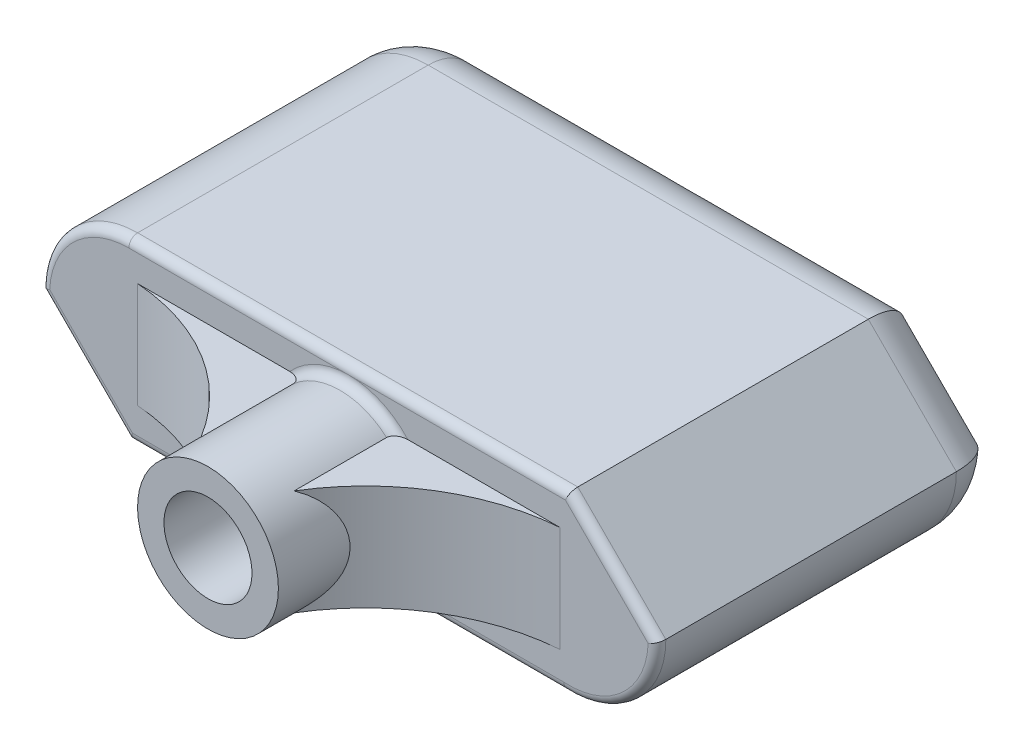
ISO-10303-21;
HEADER;
FILE_DESCRIPTION(('STEP AP214'),'2;1');
FILE_NAME('part.step','',(''),(''),'','','');
FILE_SCHEMA(('AUTOMOTIVE_DESIGN { 1 0 10303 214 1 1 1 1 }'));
ENDSEC;
DATA;
#1=APPLICATION_CONTEXT('core data for automotive mechanical design processes');
#2=APPLICATION_PROTOCOL_DEFINITION('international standard','automotive_design',2000,#1);
#3=PRODUCT_CONTEXT('',#1,'mechanical');
#4=PRODUCT('Part','Part','',(#3));
#5=PRODUCT_RELATED_PRODUCT_CATEGORY('part','',(#4));
#6=PRODUCT_DEFINITION_FORMATION('','',#4);
#7=PRODUCT_DEFINITION_CONTEXT('part definition',#1,'design');
#8=PRODUCT_DEFINITION('design','',#6,#7);
#9=PRODUCT_DEFINITION_SHAPE('','',#8);
#10=(LENGTH_UNIT() NAMED_UNIT(*) SI_UNIT(.MILLI.,.METRE.));
#11=(NAMED_UNIT(*) PLANE_ANGLE_UNIT() SI_UNIT($,.RADIAN.));
#12=(NAMED_UNIT(*) SI_UNIT($,.STERADIAN.) SOLID_ANGLE_UNIT());
#13=UNCERTAINTY_MEASURE_WITH_UNIT(LENGTH_MEASURE(1.E-05),#10,'distance_accuracy_value','');
#14=(GEOMETRIC_REPRESENTATION_CONTEXT(3) GLOBAL_UNCERTAINTY_ASSIGNED_CONTEXT((#13)) GLOBAL_UNIT_ASSIGNED_CONTEXT((#10,
#11,#12)) REPRESENTATION_CONTEXT('',''));
#15=CARTESIAN_POINT('',(0.,0.,0.));
#16=DIRECTION('',(0.,0.,1.));
#17=DIRECTION('',(1.,0.,0.));
#18=AXIS2_PLACEMENT_3D('',#15,#16,#17);
#19=CARTESIAN_POINT('',(0.,0.,0.5));
#20=DIRECTION('',(0.,0.,1.));
#21=DIRECTION('',(1.,0.,0.));
#22=AXIS2_PLACEMENT_3D('',#19,#20,#21);
#23=TOROIDAL_SURFACE('',#22,4.5,0.5);
#24=CARTESIAN_POINT('',(-3.989692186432,-3.,0.409587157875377));
#25=CARTESIAN_POINT('',(-3.98390378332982,-3.,0.384432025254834));
#26=CARTESIAN_POINT('',(-3.97572540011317,-3.,0.359812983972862));
#27=CARTESIAN_POINT('',(-3.95511351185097,-3.,0.312417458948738));
#28=CARTESIAN_POINT('',(-3.94267390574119,-3.,0.28964367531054));
#29=CARTESIAN_POINT('',(-3.91432166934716,-3.,0.246611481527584));
#30=CARTESIAN_POINT('',(-3.89843267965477,-3.,0.226337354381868));
#31=CARTESIAN_POINT('',(-3.86382452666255,-3.,0.188398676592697));
#32=CARTESIAN_POINT('',(-3.84510499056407,-3.,0.170734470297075));
#33=CARTESIAN_POINT('',(-3.79802869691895,-3.,0.1320030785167));
#34=CARTESIAN_POINT('',(-3.76868534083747,-3.,0.112132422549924));
#35=CARTESIAN_POINT('',(-3.70714780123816,-3.,0.0774315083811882));
#36=CARTESIAN_POINT('',(-3.6749481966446,-3.,0.0626111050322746));
#37=CARTESIAN_POINT('',(-3.59986685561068,-3.,0.0344776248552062));
#38=CARTESIAN_POINT('',(-3.55643543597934,-3.,0.0226335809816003));
#39=CARTESIAN_POINT('',(-3.46826703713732,-3.,0.0061782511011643));
#40=CARTESIAN_POINT('',(-3.42352959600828,-3.,0.00156955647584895));
#41=CARTESIAN_POINT('',(-3.33329398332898,-3.,-0.000910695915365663));
#42=CARTESIAN_POINT('',(-3.28779354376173,-3.,0.00130712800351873));
#43=CARTESIAN_POINT('',(-3.19754311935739,-3.,0.0123769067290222));
#44=CARTESIAN_POINT('',(-3.15279441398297,-3.,0.0212391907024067));
#45=CARTESIAN_POINT('',(-3.05903436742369,-3.,0.0472071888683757));
#46=CARTESIAN_POINT('',(-3.01028762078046,-3.,0.0652821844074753));
#47=CARTESIAN_POINT('',(-2.91705858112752,-3.,0.110268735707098));
#48=CARTESIAN_POINT('',(-2.87256308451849,-3.,0.137151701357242));
#49=CARTESIAN_POINT('',(-2.81018157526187,-3.,0.185592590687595));
#50=CARTESIAN_POINT('',(-2.78961564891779,-3.,0.203718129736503));
#51=CARTESIAN_POINT('',(-2.75135122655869,-3.,0.242785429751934));
#52=CARTESIAN_POINT('',(-2.73364806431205,-3.,0.263722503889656));
#53=CARTESIAN_POINT('',(-2.70523708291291,-3.,0.304016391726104));
#54=CARTESIAN_POINT('',(-2.69383829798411,-3.,0.322882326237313));
#55=CARTESIAN_POINT('',(-2.67426259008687,-3.,0.362233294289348));
#56=CARTESIAN_POINT('',(-2.66608336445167,-3.,0.38271715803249));
#57=CARTESIAN_POINT('',(-2.65357128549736,-3.,0.425060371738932));
#58=CARTESIAN_POINT('',(-2.64927475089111,-3.,0.446930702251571));
#59=CARTESIAN_POINT('',(-2.64513448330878,-3.,0.491085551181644));
#60=CARTESIAN_POINT('',(-2.64528716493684,-3.,0.513369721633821));
#61=CARTESIAN_POINT('',(-2.64966834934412,-3.,0.554254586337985));
#62=CARTESIAN_POINT('',(-2.65330488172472,-3.,0.572922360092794));
#63=CARTESIAN_POINT('',(-2.663513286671,-3.,0.609432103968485));
#64=CARTESIAN_POINT('',(-2.67008651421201,-3.,0.627273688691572));
#65=CARTESIAN_POINT('',(-2.68821237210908,-3.,0.667244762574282));
#66=CARTESIAN_POINT('',(-2.70068093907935,-3.,0.688957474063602));
#67=CARTESIAN_POINT('',(-2.72895825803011,-3.,0.730082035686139));
#68=CARTESIAN_POINT('',(-2.74477349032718,-3.,0.749489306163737));
#69=CARTESIAN_POINT('',(-2.78596624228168,-3.,0.79349848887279));
#70=CARTESIAN_POINT('',(-2.81259266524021,-3.,0.816927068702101));
#71=CARTESIAN_POINT('',(-2.86917372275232,-3.,0.859315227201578));
#72=CARTESIAN_POINT('',(-2.8991345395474,-3.,0.878266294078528));
#73=CARTESIAN_POINT('',(-2.97267424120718,-3.,0.918115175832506));
#74=CARTESIAN_POINT('',(-3.01723502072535,-3.,0.937202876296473));
#75=CARTESIAN_POINT('',(-3.10883395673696,-3.,0.967938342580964));
#76=CARTESIAN_POINT('',(-3.15587420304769,-3.,0.979579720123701));
#77=CARTESIAN_POINT('',(-3.25189504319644,-3.,0.995547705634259));
#78=CARTESIAN_POINT('',(-3.30089399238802,-3.,0.99976430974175));
#79=CARTESIAN_POINT('',(-3.39892480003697,-3.,1.00021617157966));
#80=CARTESIAN_POINT('',(-3.44795659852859,-3.,0.996457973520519));
#81=CARTESIAN_POINT('',(-3.5360888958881,-3.,0.981813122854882));
#82=CARTESIAN_POINT('',(-3.57541719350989,-3.,0.972298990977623));
#83=CARTESIAN_POINT('',(-3.65204364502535,-3.,0.94706326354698));
#84=CARTESIAN_POINT('',(-3.68934418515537,-3.,0.931349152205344));
#85=CARTESIAN_POINT('',(-3.75283505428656,-3.,0.897442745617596));
#86=CARTESIAN_POINT('',(-3.77969333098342,-3.,0.880503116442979));
#87=CARTESIAN_POINT('',(-3.83032760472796,-3.,0.842502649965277));
#88=CARTESIAN_POINT('',(-3.85410730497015,-3.,0.821446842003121));
#89=CARTESIAN_POINT('',(-3.89367212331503,-3.,0.779383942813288));
#90=CARTESIAN_POINT('',(-3.91012819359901,-3.,0.759009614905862));
#91=CARTESIAN_POINT('',(-3.93946169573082,-3.,0.715808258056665));
#92=CARTESIAN_POINT('',(-3.95234008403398,-3.,0.692981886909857));
#93=CARTESIAN_POINT('',(-3.97388168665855,-3.,0.645213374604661));
#94=CARTESIAN_POINT('',(-3.98251561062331,-3.,0.620257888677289));
#95=CARTESIAN_POINT('',(-3.99484237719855,-3.,0.569164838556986));
#96=CARTESIAN_POINT('',(-3.99854184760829,-3.,0.543028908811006));
#97=CARTESIAN_POINT('',(-4.00040506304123,-3.,0.498812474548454));
#98=CARTESIAN_POINT('',(-3.99994210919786,-3.,0.480779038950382));
#99=CARTESIAN_POINT('',(-3.99660423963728,-3.,0.444939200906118));
#100=CARTESIAN_POINT('',(-3.99372957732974,-3.,0.427132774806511));
#101=CARTESIAN_POINT('',(-3.989692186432,-3.,0.409587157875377));
#102=B_SPLINE_CURVE_WITH_KNOTS('',3,(#24,#25,#26,#27,#28,#29,#30,#31,#32,#33,#34,#35,#36,#37,
#38,#39,#40,#41,#42,#43,#44,#45,#46,#47,#48,#49,#50,#51,#52,#53,#54,#55,#56,#57,#58,#59,#60,#61,
#62,#63,#64,#65,#66,#67,#68,#69,#70,#71,#72,#73,#74,#75,#76,#77,#78,#79,#80,#81,#82,#83,#84,#85,
#86,#87,#88,#89,#90,#91,#92,#93,#94,#95,#96,#97,#98,#99,#100,#101),.UNSPECIFIED.,.T.,.F.,(4,2,2,
2,2,2,2,2,2,2,2,2,2,2,2,2,2,2,2,2,2,2,2,2,2,2,2,2,2,2,2,2,2,2,2,2,2,2,4),(0.,0.0773590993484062,
0.154829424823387,0.231784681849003,0.308750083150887,0.414488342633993,0.520431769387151,
0.654774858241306,0.789166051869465,0.925324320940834,1.06169469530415,1.21689503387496,
1.37159651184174,1.45361384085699,1.53549610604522,1.60137534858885,1.66720738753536,
1.73364903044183,1.80003713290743,1.85683495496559,1.9136590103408,1.98835921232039,
2.06320540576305,2.16902129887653,2.27503675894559,2.41971146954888,2.56451013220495,
2.71143660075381,2.85824254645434,2.97918461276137,3.09998113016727,3.1948918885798,
3.28968739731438,3.36793966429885,3.44617099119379,3.52493485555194,3.60359281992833,
3.65755619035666,3.71151389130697),.UNSPECIFIED.);
#103=CARTESIAN_POINT('',(-3.35410196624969,-3.,0.));
#104=VERTEX_POINT('',#103);
#105=CARTESIAN_POINT('',(-2.64575131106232,-3.,0.499999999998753));
#106=VERTEX_POINT('',#105);
#107=EDGE_CURVE('E46',#104,#106,#102,.T.);
#108=ORIENTED_EDGE('',*,*,#107,.F.);
#109=CARTESIAN_POINT('',(0.,0.,0.));
#110=DIRECTION('',(0.,0.,1.));
#111=DIRECTION('',(1.,0.,0.));
#112=AXIS2_PLACEMENT_3D('',#109,#110,#111);
#113=CIRCLE('',#112,4.5);
#114=CARTESIAN_POINT('',(0.,-4.5,0.));
#115=VERTEX_POINT('',#114);
#116=EDGE_CURVE('E486',#115,#104,#113,.F.);
#117=ORIENTED_EDGE('',*,*,#116,.F.);
#118=CARTESIAN_POINT('',(0.,0.,0.));
#119=DIRECTION('',(0.,0.,1.));
#120=DIRECTION('',(1.,0.,0.));
#121=AXIS2_PLACEMENT_3D('',#118,#119,#120);
#122=CIRCLE('',#121,4.5);
#123=CARTESIAN_POINT('',(3.35410196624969,-3.,0.));
#124=VERTEX_POINT('',#123);
#125=EDGE_CURVE('E472',#124,#115,#122,.F.);
#126=ORIENTED_EDGE('',*,*,#125,.F.);
#127=CARTESIAN_POINT('',(2.8027814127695,-3.,0.19273250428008));
#128=CARTESIAN_POINT('',(2.83467919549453,-3.,0.16477578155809));
#129=CARTESIAN_POINT('',(2.86952545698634,-3.,0.140088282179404));
#130=CARTESIAN_POINT('',(2.94291676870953,-3.,0.0968190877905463));
#131=CARTESIAN_POINT('',(2.98148080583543,-3.,0.0782711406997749));
#132=CARTESIAN_POINT('',(3.06871686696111,-3.,0.0439741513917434));
#133=CARTESIAN_POINT('',(3.11788768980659,-3.,0.0294880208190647));
#134=CARTESIAN_POINT('',(3.21789282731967,-3.,0.0087979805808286));
#135=CARTESIAN_POINT('',(3.26872646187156,-3.,0.0025907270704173));
#136=CARTESIAN_POINT('',(3.3710024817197,-3.,-0.00129338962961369));
#137=CARTESIAN_POINT('',(3.42244665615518,-3.,0.00107408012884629));
#138=CARTESIAN_POINT('',(3.52406420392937,-3.,0.0150765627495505));
#139=CARTESIAN_POINT('',(3.57423957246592,-3.,0.0266959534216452));
#140=CARTESIAN_POINT('',(3.65609537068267,-3.,0.0548019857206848));
#141=CARTESIAN_POINT('',(3.68868409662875,-3.,0.0686600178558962));
#142=CARTESIAN_POINT('',(3.75123689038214,-3.,0.101395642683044));
#143=CARTESIAN_POINT('',(3.78120492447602,-3.,0.120265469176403));
#144=CARTESIAN_POINT('',(3.83190845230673,-3.,0.159032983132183));
#145=CARTESIAN_POINT('',(3.85331524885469,-3.,0.178050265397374));
#146=CARTESIAN_POINT('',(3.8927540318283,-3.,0.219345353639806));
#147=CARTESIAN_POINT('',(3.91078662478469,-3.,0.241622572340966));
#148=CARTESIAN_POINT('',(3.94267590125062,-3.,0.289307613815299));
#149=CARTESIAN_POINT('',(3.95649451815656,-3.,0.314741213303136));
#150=CARTESIAN_POINT('',(3.97877552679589,-3.,0.367859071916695));
#151=CARTESIAN_POINT('',(3.98724417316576,-3.,0.395540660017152));
#152=CARTESIAN_POINT('',(3.99733205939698,-3.,0.44782214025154));
#153=CARTESIAN_POINT('',(3.99978731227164,-3.,0.472262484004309));
#154=CARTESIAN_POINT('',(4.00018577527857,-3.,0.521175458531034));
#155=CARTESIAN_POINT('',(3.99813104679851,-3.,0.545648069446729));
#156=CARTESIAN_POINT('',(3.98997496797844,-3.,0.591967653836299));
#157=CARTESIAN_POINT('',(3.9841945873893,-3.,0.613872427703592));
#158=CARTESIAN_POINT('',(3.96921135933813,-3.,0.656470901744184));
#159=CARTESIAN_POINT('',(3.96000819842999,-3.,0.677164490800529));
#160=CARTESIAN_POINT('',(3.93805593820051,-3.,0.717932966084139));
#161=CARTESIAN_POINT('',(3.92515064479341,-3.,0.737923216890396));
#162=CARTESIAN_POINT('',(3.89656820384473,-3.,0.775800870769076));
#163=CARTESIAN_POINT('',(3.88089003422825,-3.,0.793687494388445));
#164=CARTESIAN_POINT('',(3.84485604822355,-3.,0.829622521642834));
#165=CARTESIAN_POINT('',(3.82415166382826,-3.,0.847320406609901));
#166=CARTESIAN_POINT('',(3.78050250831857,-3.,0.879688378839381));
#167=CARTESIAN_POINT('',(3.75755582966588,-3.,0.894355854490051));
#168=CARTESIAN_POINT('',(3.69840112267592,-3.,0.927133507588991));
#169=CARTESIAN_POINT('',(3.66118404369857,-3.,0.943433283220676));
#170=CARTESIAN_POINT('',(3.58460074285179,-3.,0.969763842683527));
#171=CARTESIAN_POINT('',(3.5452313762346,-3.,0.979785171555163));
#172=CARTESIAN_POINT('',(3.46489837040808,-3.,0.994054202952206));
#173=CARTESIAN_POINT('',(3.42391999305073,-3.,0.998217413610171));
#174=CARTESIAN_POINT('',(3.34179248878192,-3.,1.0008599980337));
#175=CARTESIAN_POINT('',(3.30064332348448,-3.,0.999338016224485));
#176=CARTESIAN_POINT('',(3.21049247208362,-3.,0.989979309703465));
#177=CARTESIAN_POINT('',(3.16161587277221,-3.,0.980908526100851));
#178=CARTESIAN_POINT('',(3.06593627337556,-3.,0.954971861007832));
#179=CARTESIAN_POINT('',(3.01913332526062,-3.,0.938105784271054));
#180=CARTESIAN_POINT('',(2.94095865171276,-3.,0.901752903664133));
#181=CARTESIAN_POINT('',(2.90873777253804,-3.,0.88408646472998));
#182=CARTESIAN_POINT('',(2.8473399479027,-3.,0.844072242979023));
#183=CARTESIAN_POINT('',(2.8181574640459,-3.,0.821733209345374));
#184=CARTESIAN_POINT('',(2.77221269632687,-3.,0.779325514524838));
#185=CARTESIAN_POINT('',(2.75431046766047,-3.,0.760495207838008));
#186=CARTESIAN_POINT('',(2.72161528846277,-3.,0.720290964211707));
#187=CARTESIAN_POINT('',(2.70681780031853,-3.,0.698920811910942));
#188=CARTESIAN_POINT('',(2.68399578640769,-3.,0.658469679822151));
#189=CARTESIAN_POINT('',(2.67520391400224,-3.,0.639824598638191));
#190=CARTESIAN_POINT('',(2.66081496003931,-3.,0.6013334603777));
#191=CARTESIAN_POINT('',(2.65521511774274,-3.,0.581488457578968));
#192=CARTESIAN_POINT('',(2.64766044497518,-3.,0.540975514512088));
#193=CARTESIAN_POINT('',(2.64572827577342,-3.,0.52030325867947));
#194=CARTESIAN_POINT('',(2.64577475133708,-3.,0.478966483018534));
#195=CARTESIAN_POINT('',(2.64775246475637,-3.,0.458301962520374));
#196=CARTESIAN_POINT('',(2.65505557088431,-3.,0.419583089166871));
#197=CARTESIAN_POINT('',(2.66005233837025,-3.,0.401464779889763));
#198=CARTESIAN_POINT('',(2.67273404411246,-3.,0.366191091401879));
#199=CARTESIAN_POINT('',(2.68042163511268,-3.,0.349036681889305));
#200=CARTESIAN_POINT('',(2.70171131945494,-3.,0.309071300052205));
#201=CARTESIAN_POINT('',(2.71644407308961,-3.,0.286864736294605));
#202=CARTESIAN_POINT('',(2.74925291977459,-3.,0.245137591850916));
#203=CARTESIAN_POINT('',(2.76732865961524,-3.,0.225616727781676));
#204=CARTESIAN_POINT('',(2.79191227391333,-3.,0.202431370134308));
#205=CARTESIAN_POINT('',(2.79730336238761,-3.,0.197533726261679));
#206=CARTESIAN_POINT('',(2.8027814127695,-3.,0.19273250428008));
#207=B_SPLINE_CURVE_WITH_KNOTS('',3,(#127,#128,#129,#130,#131,#132,#133,#134,#135,#136,#137,
#138,#139,#140,#141,#142,#143,#144,#145,#146,#147,#148,#149,#150,#151,#152,#153,#154,#155,#156,
#157,#158,#159,#160,#161,#162,#163,#164,#165,#166,#167,#168,#169,#170,#171,#172,#173,#174,#175,
#176,#177,#178,#179,#180,#181,#182,#183,#184,#185,#186,#187,#188,#189,#190,#191,#192,#193,#194,
#195,#196,#197,#198,#199,#200,#201,#202,#203,#204,#205,#206),.UNSPECIFIED.,.T.,.F.,(4,2,2,2,2,2,
2,2,2,2,2,2,2,2,2,2,2,2,2,2,2,2,2,2,2,2,2,2,2,2,2,2,2,2,2,2,2,2,2,4),(0.,0.127232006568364,
0.255152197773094,0.408167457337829,0.561120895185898,0.714866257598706,0.86835256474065,
0.974218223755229,1.0799207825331,1.16548948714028,1.25104279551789,1.33734749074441,
1.42355109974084,1.49684123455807,1.57009787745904,1.63776082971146,1.70542997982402,
1.77653181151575,1.84765990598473,1.92907195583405,2.01055387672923,2.13178000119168,
2.25318824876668,2.37633022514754,2.49950156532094,2.64799875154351,2.79649965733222,
2.90640559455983,3.01610755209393,3.09381129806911,3.17140067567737,3.23299944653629,
3.29454486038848,3.35646931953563,3.41837902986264,3.4745280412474,3.53073256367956,
3.61024534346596,3.68974972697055,3.7116002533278),.UNSPECIFIED.);
#208=CARTESIAN_POINT('',(2.64575131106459,-3.,0.5));
#209=VERTEX_POINT('',#208);
#210=EDGE_CURVE('E195',#209,#124,#207,.T.);
#211=ORIENTED_EDGE('',*,*,#210,.F.);
#212=CARTESIAN_POINT('',(0.,0.,0.5));
#213=DIRECTION('',(0.,0.,1.));
#214=DIRECTION('',(1.,0.,0.));
#215=AXIS2_PLACEMENT_3D('',#212,#213,#214);
#216=CIRCLE('',#215,4.);
#217=EDGE_CURVE('E190',#106,#209,#216,.T.);
#218=ORIENTED_EDGE('',*,*,#217,.F.);
#219=EDGE_LOOP('',(#108,#117,#126,#211,#218));
#220=FACE_BOUND('',#219,.T.);
#221=ADVANCED_FACE('F32',(#220),#23,.F.);
#222=CARTESIAN_POINT('',(12.5064965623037,-0.00935519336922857,0.));
#223=DIRECTION('',(0.,0.,1.));
#224=DIRECTION('',(1.,0.,0.));
#225=AXIS2_PLACEMENT_3D('',#222,#223,#224);
#226=PLANE('',#225);
#227=DIRECTION('',(-1.,0.,0.));
#228=VECTOR('',#227,1.);
#229=CARTESIAN_POINT('',(-2.5,3.,0.));
#230=LINE('',#229,#228);
#231=CARTESIAN_POINT('',(-3.35410196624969,3.,0.));
#232=VERTEX_POINT('',#231);
#233=CARTESIAN_POINT('',(-12.,3.,0.));
#234=VERTEX_POINT('',#233);
#235=EDGE_CURVE('E548',#232,#234,#230,.T.);
#236=ORIENTED_EDGE('',*,*,#235,.F.);
#237=CARTESIAN_POINT('',(0.,4.5,0.));
#238=VERTEX_POINT('',#237);
#239=EDGE_CURVE('E485',#232,#238,#113,.F.);
#240=ORIENTED_EDGE('',*,*,#239,.T.);
#241=DIRECTION('',(1.,0.,0.));
#242=VECTOR('',#241,1.);
#243=CARTESIAN_POINT('',(-12.4935121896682,4.5,0.));
#244=LINE('',#243,#242);
#245=CARTESIAN_POINT('',(-12.4935121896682,4.5,0.));
#246=VERTEX_POINT('',#245);
#247=EDGE_CURVE('E483',#238,#246,#244,.F.);
#248=ORIENTED_EDGE('',*,*,#247,.T.);
#249=CARTESIAN_POINT('',(-12.4935121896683,0.,0.));
#250=DIRECTION('',(0.,0.,1.));
#251=DIRECTION('',(1.,0.,0.));
#252=AXIS2_PLACEMENT_3D('',#249,#250,#251);
#253=CIRCLE('',#252,4.5);
#254=CARTESIAN_POINT('',(-16.9889515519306,0.202546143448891,0.));
#255=VERTEX_POINT('',#254);
#256=EDGE_CURVE('E481',#246,#255,#253,.T.);
#257=ORIENTED_EDGE('',*,*,#256,.T.);
#258=DIRECTION('',(-0.707106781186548,0.707106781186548,0.));
#259=VECTOR('',#258,1.);
#260=CARTESIAN_POINT('',(-12.139958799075,-4.64644660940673,0.));
#261=LINE('',#260,#259);
#262=CARTESIAN_POINT('',(-12.2864054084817,-4.5,0.));
#263=VERTEX_POINT('',#262);
#264=EDGE_CURVE('E479',#255,#263,#261,.F.);
#265=ORIENTED_EDGE('',*,*,#264,.T.);
#266=DIRECTION('',(-1.,0.,0.));
#267=VECTOR('',#266,1.);
#268=CARTESIAN_POINT('',(12.2007770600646,-4.5,0.));
#269=LINE('',#268,#267);
#270=EDGE_CURVE('E476',#263,#115,#269,.F.);
#271=ORIENTED_EDGE('',*,*,#270,.T.);
#272=ORIENTED_EDGE('',*,*,#116,.T.);
#273=DIRECTION('',(-1.,0.,0.));
#274=VECTOR('',#273,1.);
#275=CARTESIAN_POINT('',(-2.5,-3.,0.));
#276=LINE('',#275,#274);
#277=CARTESIAN_POINT('',(-12.,-3.,0.));
#278=VERTEX_POINT('',#277);
#279=EDGE_CURVE('E58',#104,#278,#276,.T.);
#280=ORIENTED_EDGE('',*,*,#279,.T.);
#281=DIRECTION('',(0.,-1.,0.));
#282=VECTOR('',#281,1.);
#283=CARTESIAN_POINT('',(-12.,3.,0.));
#284=LINE('',#283,#282);
#285=EDGE_CURVE('E53',#234,#278,#284,.T.);
#286=ORIENTED_EDGE('',*,*,#285,.F.);
#287=EDGE_LOOP('',(#236,#240,#248,#257,#265,#271,#272,#280,#286));
#288=FACE_BOUND('',#287,.T.);
#289=ADVANCED_FACE('F527',(#288),#226,.T.);
#290=CARTESIAN_POINT('',(12.5064965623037,-0.00935519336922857,-20.));
#291=DIRECTION('',(0.,0.,1.));
#292=DIRECTION('',(1.,0.,0.));
#293=AXIS2_PLACEMENT_3D('',#290,#291,#292);
#294=PLANE('',#293);
#295=CARTESIAN_POINT('',(-12.4935121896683,0.,-20.));
#296=DIRECTION('',(0.,0.,1.));
#297=DIRECTION('',(1.,0.,0.));
#298=AXIS2_PLACEMENT_3D('',#295,#296,#297);
#299=CIRCLE('',#298,2.);
#300=CARTESIAN_POINT('',(-14.2347635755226,0.983892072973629,-20.));
#301=VERTEX_POINT('',#300);
#302=CARTESIAN_POINT('',(-12.4935121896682,2.,-20.));
#303=VERTEX_POINT('',#302);
#304=EDGE_CURVE('E441',#301,#303,#299,.F.);
#305=ORIENTED_EDGE('',*,*,#304,.T.);
#306=DIRECTION('',(1.,0.,0.));
#307=VECTOR('',#306,1.);
#308=CARTESIAN_POINT('',(12.5064965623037,2.,-20.));
#309=LINE('',#308,#307);
#310=CARTESIAN_POINT('',(-6.18465843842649,2.,-20.));
#311=VERTEX_POINT('',#310);
#312=EDGE_CURVE('E443',#303,#311,#309,.T.);
#313=ORIENTED_EDGE('',*,*,#312,.T.);
#314=CARTESIAN_POINT('',(0.,0.,-20.));
#315=DIRECTION('',(0.,0.,1.));
#316=DIRECTION('',(1.,0.,0.));
#317=AXIS2_PLACEMENT_3D('',#314,#315,#316);
#318=CIRCLE('',#317,6.5);
#319=CARTESIAN_POINT('',(-6.18465843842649,-2.,-20.));
#320=VERTEX_POINT('',#319);
#321=EDGE_CURVE('E435',#311,#320,#318,.T.);
#322=ORIENTED_EDGE('',*,*,#321,.T.);
#323=DIRECTION('',(-1.,0.,0.));
#324=VECTOR('',#323,1.);
#325=CARTESIAN_POINT('',(12.5064965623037,-2.,-20.));
#326=LINE('',#325,#324);
#327=CARTESIAN_POINT('',(-11.250871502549,-2.,-20.));
#328=VERTEX_POINT('',#327);
#329=EDGE_CURVE('E437',#320,#328,#326,.T.);
#330=ORIENTED_EDGE('',*,*,#329,.T.);
#331=DIRECTION('',(-0.707106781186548,0.707106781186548,0.));
#332=VECTOR('',#331,1.);
#333=CARTESIAN_POINT('',(-0.367509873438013,-12.8833616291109,-20.));
#334=LINE('',#333,#332);
#335=EDGE_CURVE('E439',#328,#301,#334,.T.);
#336=ORIENTED_EDGE('',*,*,#335,.T.);
#337=EDGE_LOOP('',(#305,#313,#322,#330,#336));
#338=FACE_BOUND('',#337,.T.);
#339=ADVANCED_FACE('F523',(#338),#294,.F.);
#340=CARTESIAN_POINT('',(0.,0.,8.));
#341=DIRECTION('',(0.,0.,-1.));
#342=DIRECTION('',(-1.,0.,0.));
#343=AXIS2_PLACEMENT_3D('',#340,#341,#342);
#344=CYLINDRICAL_SURFACE('',#343,4.);
#345=CARTESIAN_POINT('',(2.64575131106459,3.,0.5));
#346=VERTEX_POINT('',#345);
#347=CARTESIAN_POINT('',(-2.64575131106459,3.,0.5));
#348=VERTEX_POINT('',#347);
#349=EDGE_CURVE('E198',#346,#348,#216,.T.);
#350=ORIENTED_EDGE('',*,*,#349,.T.);
#351=DIRECTION('',(0.,0.,-1.));
#352=VECTOR('',#351,1.);
#353=CARTESIAN_POINT('',(-2.64575131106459,3.,8.));
#354=LINE('',#353,#352);
#355=CARTESIAN_POINT('',(-2.64575131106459,3.,5.75250832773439));
#356=VERTEX_POINT('',#355);
#357=EDGE_CURVE('E210',#348,#356,#354,.F.);
#358=ORIENTED_EDGE('',*,*,#357,.T.);
#359=CARTESIAN_POINT('',(-2.64575131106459,-3.,5.75250832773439));
#360=CARTESIAN_POINT('',(-2.70135082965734,-2.95095060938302,5.66060158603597));
#361=CARTESIAN_POINT('',(-2.75748589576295,-2.89870875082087,5.57065359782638));
#362=CARTESIAN_POINT('',(-2.87013741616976,-2.78722617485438,5.39517218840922));
#363=CARTESIAN_POINT('',(-2.92665437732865,-2.72797294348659,5.30964706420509));
#364=CARTESIAN_POINT('',(-3.03966617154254,-2.60147538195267,5.14311920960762));
#365=CARTESIAN_POINT('',(-3.09615646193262,-2.53416551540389,5.06216272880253));
#366=CARTESIAN_POINT('',(-3.20752120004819,-2.39164892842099,4.90645756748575));
#367=CARTESIAN_POINT('',(-3.26239680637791,-2.3164480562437,4.831704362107));
#368=CARTESIAN_POINT('',(-3.39879313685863,-2.11427381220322,4.65004239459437));
#369=CARTESIAN_POINT('',(-3.47841793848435,-1.98152878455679,4.54798794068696));
#370=CARTESIAN_POINT('',(-3.62569478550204,-1.69700126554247,4.36440026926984));
#371=CARTESIAN_POINT('',(-3.69338415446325,-1.54528075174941,4.28280273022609));
#372=CARTESIAN_POINT('',(-3.78228690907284,-1.30452046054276,4.1777559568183));
#373=CARTESIAN_POINT('',(-3.80993194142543,-1.22157946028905,4.14550394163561));
#374=CARTESIAN_POINT('',(-3.86018494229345,-1.05203154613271,4.08738617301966));
#375=CARTESIAN_POINT('',(-3.8827954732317,-0.965426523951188,4.06151717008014));
#376=CARTESIAN_POINT('',(-3.92241182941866,-0.789207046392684,4.01648542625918));
#377=CARTESIAN_POINT('',(-3.93941577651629,-0.699591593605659,3.99732493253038));
#378=CARTESIAN_POINT('',(-3.96734910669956,-0.518221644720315,3.96597893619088));
#379=CARTESIAN_POINT('',(-3.97827951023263,-0.426467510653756,3.95379226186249));
#380=CARTESIAN_POINT('',(-3.99266166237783,-0.254905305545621,3.93778553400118));
#381=CARTESIAN_POINT('',(-3.9969557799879,-0.175253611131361,3.93302225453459));
#382=CARTESIAN_POINT('',(-4.00076571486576,-0.0156675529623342,3.92879538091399));
#383=CARTESIAN_POINT('',(-4.00028004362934,0.0642668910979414,3.92933343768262));
#384=CARTESIAN_POINT('',(-3.99453549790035,0.223699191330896,3.93570867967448));
#385=CARTESIAN_POINT('',(-3.98927993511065,0.303197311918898,3.94154218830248));
#386=CARTESIAN_POINT('',(-3.97411763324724,0.461197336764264,3.95843678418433));
#387=CARTESIAN_POINT('',(-3.96420916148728,0.53969885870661,3.96949981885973));
#388=CARTESIAN_POINT('',(-3.92905689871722,0.764609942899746,4.00895510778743));
#389=CARTESIAN_POINT('',(-3.89802093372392,0.909037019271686,4.0439993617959));
#390=CARTESIAN_POINT('',(-3.82210067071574,1.18851449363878,4.13124546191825));
#391=CARTESIAN_POINT('',(-3.77722393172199,1.32356996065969,4.18343794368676));
#392=CARTESIAN_POINT('',(-3.67304831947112,1.5907960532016,4.30736124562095));
#393=CARTESIAN_POINT('',(-3.61298390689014,1.72216536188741,4.38016789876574));
#394=CARTESIAN_POINT('',(-3.48377447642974,1.97053294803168,4.54139224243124));
#395=CARTESIAN_POINT('',(-3.41460267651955,2.08748678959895,4.62985625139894));
#396=CARTESIAN_POINT('',(-3.28751602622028,2.28086742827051,4.79782102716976));
#397=CARTESIAN_POINT('',(-3.23071083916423,2.360402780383,4.87464259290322));
#398=CARTESIAN_POINT('',(-3.11519000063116,2.51089504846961,5.03513118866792));
#399=CARTESIAN_POINT('',(-3.0564724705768,2.58184318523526,5.11880508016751));
#400=CARTESIAN_POINT('',(-2.93878611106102,2.71503086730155,5.29142194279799));
#401=CARTESIAN_POINT('',(-2.87982175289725,2.77732669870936,5.38032492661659));
#402=CARTESIAN_POINT('',(-2.76229292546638,2.8942288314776,5.56295337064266));
#403=CARTESIAN_POINT('',(-2.70372785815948,2.94885194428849,5.65666765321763));
#404=CARTESIAN_POINT('',(-2.64575131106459,3.,5.75250832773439));
#405=B_SPLINE_CURVE_WITH_KNOTS('',3,(#359,#360,#361,#362,#363,#364,#365,#366,#367,#368,#369,
#370,#371,#372,#373,#374,#375,#376,#377,#378,#379,#380,#381,#382,#383,#384,#385,#386,#387,#388,
#389,#390,#391,#392,#393,#394,#395,#396,#397,#398,#399,#400,#401,#402,#403,#404),.UNSPECIFIED.,
.F.,.F.,(4,2,2,2,2,2,2,2,2,2,2,2,2,2,2,2,2,2,2,2,2,2,4),(0.,0.354273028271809,0.709188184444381,
1.06721654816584,1.42498141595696,1.97899438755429,2.5312429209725,2.81044155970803,
3.08949776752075,3.36864736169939,3.64775004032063,3.88716903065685,4.12666258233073,
4.3659899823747,4.60540657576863,5.05869967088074,5.51174564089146,5.99518385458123,
6.4800768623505,6.85251722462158,7.22533519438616,7.59560122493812,7.96504288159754),.UNSPECIFIED.);
#406=CARTESIAN_POINT('',(-2.64575131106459,-3.,5.75250832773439));
#407=VERTEX_POINT('',#406);
#408=EDGE_CURVE('E206',#407,#356,#405,.T.);
#409=ORIENTED_EDGE('',*,*,#408,.F.);
#410=DIRECTION('',(0.,0.,-1.));
#411=VECTOR('',#410,1.);
#412=CARTESIAN_POINT('',(-2.64575131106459,-3.,8.));
#413=LINE('',#412,#411);
#414=EDGE_CURVE('E202',#106,#407,#413,.F.);
#415=ORIENTED_EDGE('',*,*,#414,.F.);
#416=ORIENTED_EDGE('',*,*,#217,.T.);
#417=DIRECTION('',(0.,0.,-1.));
#418=VECTOR('',#417,1.);
#419=CARTESIAN_POINT('',(2.64575131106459,-3.,8.));
#420=LINE('',#419,#418);
#421=CARTESIAN_POINT('',(2.64575131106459,-3.,5.75250832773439));
#422=VERTEX_POINT('',#421);
#423=EDGE_CURVE('E274',#422,#209,#420,.T.);
#424=ORIENTED_EDGE('',*,*,#423,.F.);
#425=CARTESIAN_POINT('',(2.64575131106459,3.,5.75250832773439));
#426=CARTESIAN_POINT('',(2.70135082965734,2.95095060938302,5.66060158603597));
#427=CARTESIAN_POINT('',(2.75748589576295,2.89870875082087,5.57065359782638));
#428=CARTESIAN_POINT('',(2.87013741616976,2.78722617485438,5.39517218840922));
#429=CARTESIAN_POINT('',(2.92665437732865,2.72797294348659,5.30964706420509));
#430=CARTESIAN_POINT('',(3.03966617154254,2.60147538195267,5.14311920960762));
#431=CARTESIAN_POINT('',(3.09615646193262,2.53416551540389,5.06216272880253));
#432=CARTESIAN_POINT('',(3.20752120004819,2.39164892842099,4.90645756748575));
#433=CARTESIAN_POINT('',(3.26239680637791,2.3164480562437,4.831704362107));
#434=CARTESIAN_POINT('',(3.39879313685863,2.11427381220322,4.65004239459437));
#435=CARTESIAN_POINT('',(3.47841793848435,1.98152878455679,4.54798794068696));
#436=CARTESIAN_POINT('',(3.62569478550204,1.69700126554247,4.36440026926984));
#437=CARTESIAN_POINT('',(3.69338415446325,1.54528075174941,4.28280273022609));
#438=CARTESIAN_POINT('',(3.78228690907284,1.30452046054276,4.1777559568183));
#439=CARTESIAN_POINT('',(3.80993194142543,1.22157946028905,4.14550394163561));
#440=CARTESIAN_POINT('',(3.86018494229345,1.05203154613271,4.08738617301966));
#441=CARTESIAN_POINT('',(3.8827954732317,0.965426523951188,4.06151717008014));
#442=CARTESIAN_POINT('',(3.92241182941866,0.789207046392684,4.01648542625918));
#443=CARTESIAN_POINT('',(3.93941577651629,0.699591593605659,3.99732493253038));
#444=CARTESIAN_POINT('',(3.96734910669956,0.518221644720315,3.96597893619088));
#445=CARTESIAN_POINT('',(3.97827951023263,0.426467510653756,3.95379226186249));
#446=CARTESIAN_POINT('',(3.99266166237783,0.254905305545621,3.93778553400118));
#447=CARTESIAN_POINT('',(3.9969557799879,0.175253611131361,3.93302225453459));
#448=CARTESIAN_POINT('',(4.00076571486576,0.0156675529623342,3.92879538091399));
#449=CARTESIAN_POINT('',(4.00028004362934,-0.0642668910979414,3.92933343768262));
#450=CARTESIAN_POINT('',(3.99453549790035,-0.223699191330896,3.93570867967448));
#451=CARTESIAN_POINT('',(3.98927993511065,-0.303197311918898,3.94154218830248));
#452=CARTESIAN_POINT('',(3.97411763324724,-0.461197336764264,3.95843678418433));
#453=CARTESIAN_POINT('',(3.96420916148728,-0.53969885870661,3.96949981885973));
#454=CARTESIAN_POINT('',(3.92905689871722,-0.764609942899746,4.00895510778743));
#455=CARTESIAN_POINT('',(3.89802093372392,-0.909037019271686,4.0439993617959));
#456=CARTESIAN_POINT('',(3.82210067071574,-1.18851449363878,4.13124546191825));
#457=CARTESIAN_POINT('',(3.77722393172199,-1.32356996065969,4.18343794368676));
#458=CARTESIAN_POINT('',(3.67304831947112,-1.5907960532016,4.30736124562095));
#459=CARTESIAN_POINT('',(3.61298390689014,-1.72216536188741,4.38016789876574));
#460=CARTESIAN_POINT('',(3.48377447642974,-1.97053294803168,4.54139224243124));
#461=CARTESIAN_POINT('',(3.41460267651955,-2.08748678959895,4.62985625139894));
#462=CARTESIAN_POINT('',(3.28751602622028,-2.28086742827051,4.79782102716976));
#463=CARTESIAN_POINT('',(3.23071083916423,-2.360402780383,4.87464259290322));
#464=CARTESIAN_POINT('',(3.11519000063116,-2.51089504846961,5.03513118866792));
#465=CARTESIAN_POINT('',(3.0564724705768,-2.58184318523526,5.11880508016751));
#466=CARTESIAN_POINT('',(2.93878611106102,-2.71503086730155,5.29142194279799));
#467=CARTESIAN_POINT('',(2.87982175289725,-2.77732669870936,5.38032492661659));
#468=CARTESIAN_POINT('',(2.76229292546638,-2.8942288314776,5.56295337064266));
#469=CARTESIAN_POINT('',(2.70372785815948,-2.94885194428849,5.65666765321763));
#470=CARTESIAN_POINT('',(2.64575131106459,-3.,5.75250832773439));
#471=B_SPLINE_CURVE_WITH_KNOTS('',3,(#425,#426,#427,#428,#429,#430,#431,#432,#433,#434,#435,
#436,#437,#438,#439,#440,#441,#442,#443,#444,#445,#446,#447,#448,#449,#450,#451,#452,#453,#454,
#455,#456,#457,#458,#459,#460,#461,#462,#463,#464,#465,#466,#467,#468,#469,#470),.UNSPECIFIED.,
.F.,.F.,(4,2,2,2,2,2,2,2,2,2,2,2,2,2,2,2,2,2,2,2,2,2,4),(0.,0.354273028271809,0.709188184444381,
1.06721654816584,1.42498141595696,1.97899438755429,2.5312429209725,2.81044155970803,
3.08949776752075,3.36864736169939,3.64775004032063,3.88716903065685,4.12666258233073,
4.3659899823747,4.60540657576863,5.05869967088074,5.51174564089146,5.99518385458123,
6.4800768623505,6.85251722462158,7.22533519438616,7.59560122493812,7.96504288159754),.UNSPECIFIED.);
#472=CARTESIAN_POINT('',(2.64575131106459,3.,5.75250832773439));
#473=VERTEX_POINT('',#472);
#474=EDGE_CURVE('E266',#473,#422,#471,.T.);
#475=ORIENTED_EDGE('',*,*,#474,.F.);
#476=DIRECTION('',(0.,0.,-1.));
#477=VECTOR('',#476,1.);
#478=CARTESIAN_POINT('',(2.64575131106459,3.,8.));
#479=LINE('',#478,#477);
#480=EDGE_CURVE('E510',#473,#346,#479,.T.);
#481=ORIENTED_EDGE('',*,*,#480,.T.);
#482=EDGE_LOOP('',(#350,#358,#409,#415,#416,#424,#475,#481));
#483=FACE_BOUND('',#482,.T.);
#484=CARTESIAN_POINT('',(0.,0.,8.));
#485=DIRECTION('',(0.,0.,1.));
#486=DIRECTION('',(1.,0.,0.));
#487=AXIS2_PLACEMENT_3D('',#484,#485,#486);
#488=CIRCLE('',#487,4.);
#489=CARTESIAN_POINT('',(4.,0.,8.));
#490=VERTEX_POINT('',#489);
#491=EDGE_CURVE('E421',#490,#490,#488,.T.);
#492=ORIENTED_EDGE('',*,*,#491,.F.);
#493=EDGE_LOOP('',(#492));
#494=FACE_BOUND('',#493,.T.);
#495=ADVANCED_FACE('F34',(#483,#494),#344,.T.);
#496=CARTESIAN_POINT('',(0.,0.,8.));
#497=DIRECTION('',(0.,0.,1.));
#498=DIRECTION('',(1.,0.,0.));
#499=AXIS2_PLACEMENT_3D('',#496,#497,#498);
#500=PLANE('',#499);
#501=CARTESIAN_POINT('',(0.,0.,8.));
#502=DIRECTION('',(0.,0.,1.));
#503=DIRECTION('',(1.,0.,0.));
#504=AXIS2_PLACEMENT_3D('',#501,#502,#503);
#505=CIRCLE('',#504,2.5);
#506=CARTESIAN_POINT('',(2.5,0.,8.));
#507=VERTEX_POINT('',#506);
#508=EDGE_CURVE('E503',#507,#507,#505,.T.);
#509=ORIENTED_EDGE('',*,*,#508,.F.);
#510=EDGE_LOOP('',(#509));
#511=FACE_BOUND('',#510,.T.);
#512=ORIENTED_EDGE('',*,*,#491,.T.);
#513=EDGE_LOOP('',(#512));
#514=FACE_BOUND('',#513,.T.);
#515=ADVANCED_FACE('F517',(#511,#514),#500,.T.);
#516=DIRECTION('',(-1.,0.,0.));
#517=VECTOR('',#516,1.);
#518=CARTESIAN_POINT('',(2.5,3.,0.));
#519=LINE('',#518,#517);
#520=CARTESIAN_POINT('',(12.,3.,0.));
#521=VERTEX_POINT('',#520);
#522=CARTESIAN_POINT('',(3.35410196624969,3.,0.));
#523=VERTEX_POINT('',#522);
#524=EDGE_CURVE('E258',#521,#523,#519,.T.);
#525=ORIENTED_EDGE('',*,*,#524,.F.);
#526=DIRECTION('',(0.,-1.,0.));
#527=VECTOR('',#526,1.);
#528=CARTESIAN_POINT('',(12.,3.,0.));
#529=LINE('',#528,#527);
#530=CARTESIAN_POINT('',(12.,-3.,0.));
#531=VERTEX_POINT('',#530);
#532=EDGE_CURVE('E264',#521,#531,#529,.T.);
#533=ORIENTED_EDGE('',*,*,#532,.T.);
#534=DIRECTION('',(-1.,0.,0.));
#535=VECTOR('',#534,1.);
#536=CARTESIAN_POINT('',(2.5,-3.,0.));
#537=LINE('',#536,#535);
#538=EDGE_CURVE('E252',#531,#124,#537,.T.);
#539=ORIENTED_EDGE('',*,*,#538,.T.);
#540=ORIENTED_EDGE('',*,*,#125,.T.);
#541=DIRECTION('',(-1.,0.,0.));
#542=VECTOR('',#541,1.);
#543=CARTESIAN_POINT('',(12.2007770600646,-4.5,0.));
#544=LINE('',#543,#542);
#545=CARTESIAN_POINT('',(12.216480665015,-4.49999999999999,0.));
#546=VERTEX_POINT('',#545);
#547=EDGE_CURVE('E474',#115,#546,#544,.F.);
#548=ORIENTED_EDGE('',*,*,#547,.T.);
#549=CARTESIAN_POINT('',(12.5064965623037,-0.00935519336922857,0.));
#550=DIRECTION('',(0.,0.,1.));
#551=DIRECTION('',(1.,0.,0.));
#552=AXIS2_PLACEMENT_3D('',#549,#550,#551);
#553=CIRCLE('',#552,4.5);
#554=CARTESIAN_POINT('',(17.0023303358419,-0.202949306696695,0.));
#555=VERTEX_POINT('',#554);
#556=EDGE_CURVE('E466',#546,#555,#553,.T.);
#557=ORIENTED_EDGE('',*,*,#556,.T.);
#558=DIRECTION('',(0.707106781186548,-0.707106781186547,0.));
#559=VECTOR('',#558,1.);
#560=CARTESIAN_POINT('',(12.1529344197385,4.64644660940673,0.));
#561=LINE('',#560,#559);
#562=CARTESIAN_POINT('',(12.2993810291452,4.5,0.));
#563=VERTEX_POINT('',#562);
#564=EDGE_CURVE('E461',#555,#563,#561,.F.);
#565=ORIENTED_EDGE('',*,*,#564,.T.);
#566=DIRECTION('',(1.,0.,0.));
#567=VECTOR('',#566,1.);
#568=CARTESIAN_POINT('',(-12.4935121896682,4.5,0.));
#569=LINE('',#568,#567);
#570=EDGE_CURVE('E463',#563,#238,#569,.F.);
#571=ORIENTED_EDGE('',*,*,#570,.T.);
#572=CARTESIAN_POINT('',(0.,0.,0.));
#573=DIRECTION('',(0.,0.,1.));
#574=DIRECTION('',(1.,0.,0.));
#575=AXIS2_PLACEMENT_3D('',#572,#573,#574);
#576=CIRCLE('',#575,4.5);
#577=EDGE_CURVE('E469',#238,#523,#576,.F.);
#578=ORIENTED_EDGE('',*,*,#577,.T.);
#579=EDGE_LOOP('',(#525,#533,#539,#540,#548,#557,#565,#571,#578));
#580=FACE_BOUND('',#579,.T.);
#581=ADVANCED_FACE('F520',(#580),#226,.T.);
#582=CARTESIAN_POINT('',(12.5064878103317,5.,-20.));
#583=DIRECTION('',(-0.707106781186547,-0.707106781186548,0.));
#584=DIRECTION('',(0.707106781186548,-0.707106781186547,0.));
#585=AXIS2_PLACEMENT_3D('',#582,#583,#584);
#586=PLANE('',#585);
#587=DIRECTION('',(0.,0.,1.));
#588=VECTOR('',#587,1.);
#589=CARTESIAN_POINT('',(12.5064878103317,5.,-20.));
#590=LINE('',#589,#588);
#591=CARTESIAN_POINT('',(12.5064878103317,5.,-17.));
#592=VERTEX_POINT('',#591);
#593=CARTESIAN_POINT('',(12.5064878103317,5.,-0.499999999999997));
#594=VERTEX_POINT('',#593);
#595=EDGE_CURVE('E403',#592,#594,#590,.T.);
#596=ORIENTED_EDGE('',*,*,#595,.T.);
#597=DIRECTION('',(0.707106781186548,-0.707106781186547,0.));
#598=VECTOR('',#597,1.);
#599=CARTESIAN_POINT('',(17.5064878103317,0.,-0.5));
#600=LINE('',#599,#598);
#601=CARTESIAN_POINT('',(17.5064878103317,0.,-0.499999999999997));
#602=VERTEX_POINT('',#601);
#603=EDGE_CURVE('E499',#594,#602,#600,.T.);
#604=ORIENTED_EDGE('',*,*,#603,.T.);
#605=DIRECTION('',(0.,0.,1.));
#606=VECTOR('',#605,1.);
#607=CARTESIAN_POINT('',(17.5064878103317,0.,-20.));
#608=LINE('',#607,#606);
#609=CARTESIAN_POINT('',(17.5064878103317,0.,-17.));
#610=VERTEX_POINT('',#609);
#611=EDGE_CURVE('E418',#610,#602,#608,.T.);
#612=ORIENTED_EDGE('',*,*,#611,.F.);
#613=DIRECTION('',(0.707106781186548,-0.707106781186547,0.));
#614=VECTOR('',#613,1.);
#615=CARTESIAN_POINT('',(12.5064878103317,5.,-17.));
#616=LINE('',#615,#614);
#617=EDGE_CURVE('E457',#610,#592,#616,.F.);
#618=ORIENTED_EDGE('',*,*,#617,.T.);
#619=EDGE_LOOP('',(#596,#604,#612,#618));
#620=FACE_BOUND('',#619,.T.);
#621=ADVANCED_FACE('F596',(#620),#586,.F.);
#622=CARTESIAN_POINT('',(12.5064965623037,-0.00935519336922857,-20.));
#623=DIRECTION('',(0.,0.,1.));
#624=DIRECTION('',(1.,0.,0.));
#625=AXIS2_PLACEMENT_3D('',#622,#623,#624);
#626=CYLINDRICAL_SURFACE('',#625,5.);
#627=ORIENTED_EDGE('',*,*,#611,.T.);
#628=CARTESIAN_POINT('',(12.5064965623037,-0.00935519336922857,-0.5));
#629=DIRECTION('',(0.,0.,1.));
#630=DIRECTION('',(1.,0.,0.));
#631=AXIS2_PLACEMENT_3D('',#628,#629,#630);
#632=CIRCLE('',#631,5.);
#633=CARTESIAN_POINT('',(12.2007770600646,-5.,-0.499999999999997));
#634=VERTEX_POINT('',#633);
#635=EDGE_CURVE('E488',#602,#634,#632,.F.);
#636=ORIENTED_EDGE('',*,*,#635,.T.);
#637=DIRECTION('',(0.,0.,1.));
#638=VECTOR('',#637,1.);
#639=CARTESIAN_POINT('',(12.2007770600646,-5.,-20.));
#640=LINE('',#639,#638);
#641=CARTESIAN_POINT('',(12.2007770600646,-5.,-17.));
#642=VERTEX_POINT('',#641);
#643=EDGE_CURVE('E415',#642,#634,#640,.T.);
#644=ORIENTED_EDGE('',*,*,#643,.F.);
#645=CARTESIAN_POINT('',(12.5064965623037,-0.00935519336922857,-17.));
#646=DIRECTION('',(0.,0.,1.));
#647=DIRECTION('',(1.,0.,0.));
#648=AXIS2_PLACEMENT_3D('',#645,#646,#647);
#649=CIRCLE('',#648,5.);
#650=EDGE_CURVE('E455',#642,#610,#649,.T.);
#651=ORIENTED_EDGE('',*,*,#650,.T.);
#652=EDGE_LOOP('',(#627,#636,#644,#651));
#653=FACE_BOUND('',#652,.T.);
#654=ADVANCED_FACE('F620',(#653),#626,.T.);
#655=CARTESIAN_POINT('',(12.2007770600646,-5.,-20.));
#656=DIRECTION('',(0.,1.,0.));
#657=DIRECTION('',(0.,0.,1.));
#658=AXIS2_PLACEMENT_3D('',#655,#656,#657);
#659=PLANE('',#658);
#660=ORIENTED_EDGE('',*,*,#643,.T.);
#661=DIRECTION('',(-1.,0.,0.));
#662=VECTOR('',#661,1.);
#663=CARTESIAN_POINT('',(-12.4935121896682,-5.,-0.5));
#664=LINE('',#663,#662);
#665=CARTESIAN_POINT('',(-12.4935121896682,-5.,-0.499999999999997));
#666=VERTEX_POINT('',#665);
#667=EDGE_CURVE('E491',#634,#666,#664,.T.);
#668=ORIENTED_EDGE('',*,*,#667,.T.);
#669=DIRECTION('',(0.,0.,1.));
#670=VECTOR('',#669,1.);
#671=CARTESIAN_POINT('',(-12.4935121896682,-5.,-20.));
#672=LINE('',#671,#670);
#673=CARTESIAN_POINT('',(-12.4935121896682,-5.,-17.));
#674=VERTEX_POINT('',#673);
#675=EDGE_CURVE('E412',#674,#666,#672,.T.);
#676=ORIENTED_EDGE('',*,*,#675,.F.);
#677=DIRECTION('',(-1.,0.,0.));
#678=VECTOR('',#677,1.);
#679=CARTESIAN_POINT('',(12.2007770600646,-5.,-17.));
#680=LINE('',#679,#678);
#681=EDGE_CURVE('E453',#674,#642,#680,.F.);
#682=ORIENTED_EDGE('',*,*,#681,.T.);
#683=EDGE_LOOP('',(#660,#668,#676,#682));
#684=FACE_BOUND('',#683,.T.);
#685=ADVANCED_FACE('F616',(#684),#659,.F.);
#686=CARTESIAN_POINT('',(-12.4935121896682,-5.,-20.));
#687=DIRECTION('',(0.707106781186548,0.707106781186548,0.));
#688=DIRECTION('',(-0.707106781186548,0.707106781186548,0.));
#689=AXIS2_PLACEMENT_3D('',#686,#687,#688);
#690=PLANE('',#689);
#691=ORIENTED_EDGE('',*,*,#675,.T.);
#692=DIRECTION('',(-0.707106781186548,0.707106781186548,0.));
#693=VECTOR('',#692,1.);
#694=CARTESIAN_POINT('',(-17.4935121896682,0.,-0.5));
#695=LINE('',#694,#693);
#696=CARTESIAN_POINT('',(-17.4935121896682,0.,-0.499999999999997));
#697=VERTEX_POINT('',#696);
#698=EDGE_CURVE('E493',#666,#697,#695,.T.);
#699=ORIENTED_EDGE('',*,*,#698,.T.);
#700=DIRECTION('',(0.,0.,1.));
#701=VECTOR('',#700,1.);
#702=CARTESIAN_POINT('',(-17.4935121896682,0.,-20.));
#703=LINE('',#702,#701);
#704=CARTESIAN_POINT('',(-17.4935121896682,0.,-17.));
#705=VERTEX_POINT('',#704);
#706=EDGE_CURVE('E409',#705,#697,#703,.T.);
#707=ORIENTED_EDGE('',*,*,#706,.F.);
#708=DIRECTION('',(-0.707106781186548,0.707106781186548,0.));
#709=VECTOR('',#708,1.);
#710=CARTESIAN_POINT('',(-12.4935121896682,-5.,-17.));
#711=LINE('',#710,#709);
#712=EDGE_CURVE('E451',#705,#674,#711,.F.);
#713=ORIENTED_EDGE('',*,*,#712,.T.);
#714=EDGE_LOOP('',(#691,#699,#707,#713));
#715=FACE_BOUND('',#714,.T.);
#716=ADVANCED_FACE('F581',(#715),#690,.F.);
#717=CARTESIAN_POINT('',(-12.4935121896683,0.,-20.));
#718=DIRECTION('',(0.,0.,1.));
#719=DIRECTION('',(1.,0.,0.));
#720=AXIS2_PLACEMENT_3D('',#717,#718,#719);
#721=CYLINDRICAL_SURFACE('',#720,5.);
#722=ORIENTED_EDGE('',*,*,#706,.T.);
#723=CARTESIAN_POINT('',(-12.4935121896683,0.,-0.5));
#724=DIRECTION('',(0.,0.,1.));
#725=DIRECTION('',(1.,0.,0.));
#726=AXIS2_PLACEMENT_3D('',#723,#724,#725);
#727=CIRCLE('',#726,5.);
#728=CARTESIAN_POINT('',(-12.4935121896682,5.,-0.5));
#729=VERTEX_POINT('',#728);
#730=EDGE_CURVE('E495',#697,#729,#727,.F.);
#731=ORIENTED_EDGE('',*,*,#730,.T.);
#732=DIRECTION('',(0.,0.,1.));
#733=VECTOR('',#732,1.);
#734=CARTESIAN_POINT('',(-12.4935121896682,5.,-20.));
#735=LINE('',#734,#733);
#736=CARTESIAN_POINT('',(-12.4935121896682,5.,-17.));
#737=VERTEX_POINT('',#736);
#738=EDGE_CURVE('E406',#737,#729,#735,.T.);
#739=ORIENTED_EDGE('',*,*,#738,.F.);
#740=CARTESIAN_POINT('',(-12.4935121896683,0.,-17.));
#741=DIRECTION('',(0.,0.,1.));
#742=DIRECTION('',(1.,0.,0.));
#743=AXIS2_PLACEMENT_3D('',#740,#741,#742);
#744=CIRCLE('',#743,5.);
#745=EDGE_CURVE('E449',#737,#705,#744,.T.);
#746=ORIENTED_EDGE('',*,*,#745,.T.);
#747=EDGE_LOOP('',(#722,#731,#739,#746));
#748=FACE_BOUND('',#747,.T.);
#749=ADVANCED_FACE('F586',(#748),#721,.T.);
#750=CARTESIAN_POINT('',(12.5064878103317,5.,-20.));
#751=DIRECTION('',(0.,-1.,0.));
#752=DIRECTION('',(0.,0.,-1.));
#753=AXIS2_PLACEMENT_3D('',#750,#751,#752);
#754=PLANE('',#753);
#755=ORIENTED_EDGE('',*,*,#738,.T.);
#756=DIRECTION('',(1.,0.,0.));
#757=VECTOR('',#756,1.);
#758=CARTESIAN_POINT('',(12.5064878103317,5.,-0.5));
#759=LINE('',#758,#757);
#760=EDGE_CURVE('E497',#729,#594,#759,.T.);
#761=ORIENTED_EDGE('',*,*,#760,.T.);
#762=ORIENTED_EDGE('',*,*,#595,.F.);
#763=DIRECTION('',(1.,0.,0.));
#764=VECTOR('',#763,1.);
#765=CARTESIAN_POINT('',(12.5064878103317,5.,-17.));
#766=LINE('',#765,#764);
#767=EDGE_CURVE('E446',#592,#737,#766,.F.);
#768=ORIENTED_EDGE('',*,*,#767,.T.);
#769=EDGE_LOOP('',(#755,#761,#762,#768));
#770=FACE_BOUND('',#769,.T.);
#771=ADVANCED_FACE('F593',(#770),#754,.F.);
#772=DIRECTION('',(0.707106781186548,-0.707106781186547,0.));
#773=VECTOR('',#772,1.);
#774=CARTESIAN_POINT('',(12.8898494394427,0.373997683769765,-20.));
#775=LINE('',#774,#773);
#776=CARTESIAN_POINT('',(11.2638471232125,2.,-20.));
#777=VERTEX_POINT('',#776);
#778=CARTESIAN_POINT('',(14.2511137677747,-0.987266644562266,-20.));
#779=VERTEX_POINT('',#778);
#780=EDGE_CURVE('E431',#777,#779,#775,.T.);
#781=ORIENTED_EDGE('',*,*,#780,.T.);
#782=CARTESIAN_POINT('',(12.5064965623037,-0.00935519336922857,-20.));
#783=DIRECTION('',(0.,0.,1.));
#784=DIRECTION('',(1.,0.,0.));
#785=AXIS2_PLACEMENT_3D('',#782,#783,#784);
#786=CIRCLE('',#785,2.);
#787=CARTESIAN_POINT('',(12.3132784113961,-2.,-20.));
#788=VERTEX_POINT('',#787);
#789=EDGE_CURVE('E433',#779,#788,#786,.F.);
#790=ORIENTED_EDGE('',*,*,#789,.T.);
#791=DIRECTION('',(-1.,0.,0.));
#792=VECTOR('',#791,1.);
#793=CARTESIAN_POINT('',(12.5064965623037,-2.,-20.));
#794=LINE('',#793,#792);
#795=CARTESIAN_POINT('',(6.18465843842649,-2.,-20.));
#796=VERTEX_POINT('',#795);
#797=EDGE_CURVE('E426',#788,#796,#794,.T.);
#798=ORIENTED_EDGE('',*,*,#797,.T.);
#799=CARTESIAN_POINT('',(0.,0.,-20.));
#800=DIRECTION('',(0.,0.,1.));
#801=DIRECTION('',(1.,0.,0.));
#802=AXIS2_PLACEMENT_3D('',#799,#800,#801);
#803=CIRCLE('',#802,6.5);
#804=CARTESIAN_POINT('',(6.18465843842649,2.,-20.));
#805=VERTEX_POINT('',#804);
#806=EDGE_CURVE('E424',#796,#805,#803,.T.);
#807=ORIENTED_EDGE('',*,*,#806,.T.);
#808=DIRECTION('',(1.,0.,0.));
#809=VECTOR('',#808,1.);
#810=CARTESIAN_POINT('',(12.5064965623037,2.,-20.));
#811=LINE('',#810,#809);
#812=EDGE_CURVE('E428',#805,#777,#811,.T.);
#813=ORIENTED_EDGE('',*,*,#812,.T.);
#814=EDGE_LOOP('',(#781,#790,#798,#807,#813));
#815=FACE_BOUND('',#814,.T.);
#816=ADVANCED_FACE('F530',(#815),#294,.F.);
#817=CARTESIAN_POINT('',(0.,0.,-16.));
#818=DIRECTION('',(0.,0.,-1.));
#819=DIRECTION('',(-1.,0.,0.));
#820=AXIS2_PLACEMENT_3D('',#817,#818,#819);
#821=CYLINDRICAL_SURFACE('',#820,3.5);
#822=CARTESIAN_POINT('',(0.,0.,-17.));
#823=DIRECTION('',(0.,0.,1.));
#824=DIRECTION('',(1.,0.,0.));
#825=AXIS2_PLACEMENT_3D('',#822,#823,#824);
#826=CIRCLE('',#825,3.5);
#827=CARTESIAN_POINT('',(3.5,0.,-17.));
#828=VERTEX_POINT('',#827);
#829=EDGE_CURVE('E199',#828,#828,#826,.F.);
#830=ORIENTED_EDGE('',*,*,#829,.T.);
#831=EDGE_LOOP('',(#830));
#832=FACE_BOUND('',#831,.T.);
#833=CARTESIAN_POINT('',(0.,0.,-16.));
#834=DIRECTION('',(0.,0.,-1.));
#835=DIRECTION('',(-1.,0.,0.));
#836=AXIS2_PLACEMENT_3D('',#833,#834,#835);
#837=CIRCLE('',#836,3.5);
#838=CARTESIAN_POINT('',(-3.5,0.,-16.));
#839=VERTEX_POINT('',#838);
#840=EDGE_CURVE('E400',#839,#839,#837,.T.);
#841=ORIENTED_EDGE('',*,*,#840,.F.);
#842=EDGE_LOOP('',(#841));
#843=FACE_BOUND('',#842,.T.);
#844=ADVANCED_FACE('F634',(#832,#843),#821,.F.);
#845=CARTESIAN_POINT('',(0.,0.,-16.));
#846=DIRECTION('',(0.,0.,-1.));
#847=DIRECTION('',(-1.,0.,0.));
#848=AXIS2_PLACEMENT_3D('',#845,#846,#847);
#849=PLANE('',#848);
#850=CARTESIAN_POINT('',(0.,0.,-16.));
#851=DIRECTION('',(0.,0.,-1.));
#852=DIRECTION('',(-1.,0.,0.));
#853=AXIS2_PLACEMENT_3D('',#850,#851,#852);
#854=CIRCLE('',#853,2.5);
#855=CARTESIAN_POINT('',(-2.5,0.,-16.));
#856=VERTEX_POINT('',#855);
#857=EDGE_CURVE('E501',#856,#856,#854,.T.);
#858=ORIENTED_EDGE('',*,*,#857,.F.);
#859=EDGE_LOOP('',(#858));
#860=FACE_BOUND('',#859,.T.);
#861=ORIENTED_EDGE('',*,*,#840,.T.);
#862=EDGE_LOOP('',(#861));
#863=FACE_BOUND('',#862,.T.);
#864=ADVANCED_FACE('F639',(#860,#863),#849,.T.);
#865=CARTESIAN_POINT('',(-0.367509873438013,-12.8833616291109,-17.));
#866=DIRECTION('',(-0.707106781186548,0.707106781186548,0.));
#867=DIRECTION('',(-0.707106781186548,-0.707106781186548,0.));
#868=AXIS2_PLACEMENT_3D('',#865,#866,#867);
#869=CYLINDRICAL_SURFACE('',#868,3.);
#870=CARTESIAN_POINT('',(-17.4935121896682,0.,-17.));
#871=CARTESIAN_POINT('',(-17.4935209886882,-6.66803775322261E-06,-17.0792837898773));
#872=CARTESIAN_POINT('',(-17.4903693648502,0.00130172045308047,-17.1585624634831));
#873=CARTESIAN_POINT('',(-17.4778133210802,0.00649845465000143,-17.3165258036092));
#874=CARTESIAN_POINT('',(-17.4684098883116,0.0103863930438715,-17.3952105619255));
#875=CARTESIAN_POINT('',(-17.4434467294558,0.0206803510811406,-17.5512495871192));
#876=CARTESIAN_POINT('',(-17.4279010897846,0.0270806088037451,-17.6286064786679));
#877=CARTESIAN_POINT('',(-17.3908004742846,0.0422948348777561,-17.7816014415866));
#878=CARTESIAN_POINT('',(-17.3692454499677,0.051108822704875,-17.8572394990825));
#879=CARTESIAN_POINT('',(-17.2958076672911,0.0809894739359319,-18.0807719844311));
#880=CARTESIAN_POINT('',(-17.2351278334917,0.105505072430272,-18.2254355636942));
#881=CARTESIAN_POINT('',(-17.0923196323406,0.162273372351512,-18.5019949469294));
#882=CARTESIAN_POINT('',(-17.0101865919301,0.194527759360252,-18.6338879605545));
#883=CARTESIAN_POINT('',(-16.824765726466,0.265756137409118,-18.884841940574));
#884=CARTESIAN_POINT('',(-16.7210282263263,0.304869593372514,-19.0035308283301));
#885=CARTESIAN_POINT('',(-16.4966336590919,0.386975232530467,-19.2220183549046));
#886=CARTESIAN_POINT('',(-16.3759736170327,0.429968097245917,-19.3218136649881));
#887=CARTESIAN_POINT('',(-16.1126564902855,0.520149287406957,-19.5068061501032));
#888=CARTESIAN_POINT('',(-15.9690835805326,0.567429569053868,-19.5906508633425));
#889=CARTESIAN_POINT('',(-15.6698963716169,0.660450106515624,-19.7346155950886));
#890=CARTESIAN_POINT('',(-15.514271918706,0.706189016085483,-19.7947153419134));
#891=CARTESIAN_POINT('',(-15.2657917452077,0.773515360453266,-19.8699429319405));
#892=CARTESIAN_POINT('',(-15.175750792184,0.796808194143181,-19.8931899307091));
#893=CARTESIAN_POINT('',(-14.9936393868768,0.841300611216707,-19.9326565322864));
#894=CARTESIAN_POINT('',(-14.9015694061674,0.862500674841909,-19.9488777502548));
#895=CARTESIAN_POINT('',(-14.7160855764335,0.902160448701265,-19.9745554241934));
#896=CARTESIAN_POINT('',(-14.6226741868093,0.920624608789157,-19.9840229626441));
#897=CARTESIAN_POINT('',(-14.4348652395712,0.954195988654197,-19.9966238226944));
#898=CARTESIAN_POINT('',(-14.3404682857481,0.969305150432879,-19.9997608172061));
#899=CARTESIAN_POINT('',(-14.2421349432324,0.98288364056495,-19.9999956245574));
#900=CARTESIAN_POINT('',(-14.2384494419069,0.983389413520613,-20.0000000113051));
#901=CARTESIAN_POINT('',(-14.2347635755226,0.983892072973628,-20.));
#902=B_SPLINE_CURVE_WITH_KNOTS('',3,(#870,#871,#872,#873,#874,#875,#876,#877,#878,#879,#880,
#881,#882,#883,#884,#885,#886,#887,#888,#889,#890,#891,#892,#893,#894,#895,#896,#897,#898,#899,
#900,#901),.UNSPECIFIED.,.F.,.F.,(4,2,2,2,2,2,2,2,2,2,2,2,2,2,2,4),(0.,0.237769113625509,
0.475500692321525,0.712690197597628,0.949881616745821,1.42381085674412,1.89784341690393,
2.3829580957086,2.86815816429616,3.38457780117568,3.90143737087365,4.18877770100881,
4.47605193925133,4.76285368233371,5.04948897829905,5.06064909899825),.UNSPECIFIED.);
#903=EDGE_CURVE('E368',#301,#705,#902,.F.);
#904=ORIENTED_EDGE('',*,*,#903,.F.);
#905=ORIENTED_EDGE('',*,*,#335,.F.);
#906=CARTESIAN_POINT('',(-11.250871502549,-2.,-17.));
#907=DIRECTION('',(-0.923879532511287,0.38268343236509,0.));
#908=DIRECTION('',(-0.38268343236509,-0.923879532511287,0.));
#909=AXIS2_PLACEMENT_3D('',#906,#907,#908);
#910=ELLIPSE('',#909,3.24717660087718,3.);
#911=EDGE_CURVE('E397',#674,#328,#910,.F.);
#912=ORIENTED_EDGE('',*,*,#911,.F.);
#913=ORIENTED_EDGE('',*,*,#712,.F.);
#914=EDGE_LOOP('',(#904,#905,#912,#913));
#915=FACE_BOUND('',#914,.T.);
#916=ADVANCED_FACE('F385',(#915),#869,.T.);
#917=CARTESIAN_POINT('',(12.5064965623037,-2.,-17.));
#918=DIRECTION('',(-1.,0.,0.));
#919=DIRECTION('',(0.,0.,1.));
#920=AXIS2_PLACEMENT_3D('',#917,#918,#919);
#921=CYLINDRICAL_SURFACE('',#920,3.);
#922=CARTESIAN_POINT('',(6.18465843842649,-2.,-20.));
#923=CARTESIAN_POINT('',(6.18163150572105,-2.0022024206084,-19.9999999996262));
#924=CARTESIAN_POINT('',(6.17860378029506,-2.00440379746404,-19.9999975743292));
#925=CARTESIAN_POINT('',(5.98113891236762,-2.14786935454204,-19.9996817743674));
#926=CARTESIAN_POINT('',(5.78344424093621,-2.28481645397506,-19.9894036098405));
#927=CARTESIAN_POINT('',(5.38252127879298,-2.54816043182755,-19.952494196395));
#928=CARTESIAN_POINT('',(5.17928777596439,-2.67454688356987,-19.9258469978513));
#929=CARTESIAN_POINT('',(4.76672063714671,-2.91595070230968,-19.85950673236));
#930=CARTESIAN_POINT('',(4.55735929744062,-3.03090071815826,-19.8197417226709));
#931=CARTESIAN_POINT('',(4.13387924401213,-3.24740435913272,-19.7308731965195));
#932=CARTESIAN_POINT('',(3.91976211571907,-3.34896237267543,-19.681772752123));
#933=CARTESIAN_POINT('',(3.46518201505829,-3.54701001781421,-19.573077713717));
#934=CARTESIAN_POINT('',(3.2242041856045,-3.64201066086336,-19.5129256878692));
#935=CARTESIAN_POINT('',(2.73549804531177,-3.81334079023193,-19.3922293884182));
#936=CARTESIAN_POINT('',(2.48776486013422,-3.88965637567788,-19.331684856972));
#937=CARTESIAN_POINT('',(2.11178727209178,-3.98858285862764,-19.2466492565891));
#938=CARTESIAN_POINT('',(1.98617906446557,-4.01888794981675,-19.2193531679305));
#939=CARTESIAN_POINT('',(1.73318303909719,-4.07423986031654,-19.1677078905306));
#940=CARTESIAN_POINT('',(1.6057951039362,-4.09928633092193,-19.1433588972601));
#941=CARTESIAN_POINT('',(1.3495493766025,-4.14382952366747,-19.0988065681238));
#942=CARTESIAN_POINT('',(1.22069441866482,-4.16333551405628,-19.0785963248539));
#943=CARTESIAN_POINT('',(0.961556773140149,-4.19659918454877,-19.0434140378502));
#944=CARTESIAN_POINT('',(0.831274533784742,-4.21035861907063,-19.0284403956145));
#945=CARTESIAN_POINT('',(0.58429356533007,-4.23071143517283,-19.0060235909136));
#946=CARTESIAN_POINT('',(0.467706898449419,-4.23793459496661,-18.9979250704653));
#947=CARTESIAN_POINT('',(0.234085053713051,-4.24757975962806,-18.9870668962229));
#948=CARTESIAN_POINT('',(0.117049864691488,-4.25000164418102,-18.9843073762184));
#949=CARTESIAN_POINT('',(-0.173781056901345,-4.24999755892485,-18.98432255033));
#950=CARTESIAN_POINT('',(-0.347594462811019,-4.24465302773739,-18.9904277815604));
#951=CARTESIAN_POINT('',(-0.693845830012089,-4.22344703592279,-19.0140799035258));
#952=CARTESIAN_POINT('',(-0.866282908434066,-4.20757930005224,-19.0316336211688));
#953=CARTESIAN_POINT('',(-1.20945330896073,-4.1656948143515,-19.0762214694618));
#954=CARTESIAN_POINT('',(-1.38017510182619,-4.13963158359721,-19.1032989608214));
#955=CARTESIAN_POINT('',(-1.71868364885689,-4.07792943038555,-19.1642740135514));
#956=CARTESIAN_POINT('',(-1.8864690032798,-4.04228606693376,-19.1981747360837));
#957=CARTESIAN_POINT('',(-2.19440188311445,-3.96792255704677,-19.2648163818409));
#958=CARTESIAN_POINT('',(-2.33497470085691,-3.93043226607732,-19.2969904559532));
#959=CARTESIAN_POINT('',(-2.61391089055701,-3.84923042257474,-19.3628539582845));
#960=CARTESIAN_POINT('',(-2.7522747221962,-3.80552018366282,-19.3965430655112));
#961=CARTESIAN_POINT('',(-3.0270468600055,-3.71211046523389,-19.464143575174));
#962=CARTESIAN_POINT('',(-3.16345338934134,-3.6624058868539,-19.4980551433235));
#963=CARTESIAN_POINT('',(-3.43429695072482,-3.55729089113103,-19.5649037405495));
#964=CARTESIAN_POINT('',(-3.56873379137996,-3.50187992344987,-19.5978406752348));
#965=CARTESIAN_POINT('',(-3.96846648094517,-3.32777405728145,-19.6934133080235));
#966=CARTESIAN_POINT('',(-4.23099621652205,-3.20092692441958,-19.7530236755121));
#967=CARTESIAN_POINT('',(-4.74851013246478,-2.92755736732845,-19.8567494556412));
#968=CARTESIAN_POINT('',(-5.00350203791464,-2.78105600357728,-19.9008812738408));
#969=CARTESIAN_POINT('',(-5.41135043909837,-2.52893517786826,-19.954667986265));
#970=CARTESIAN_POINT('',(-5.56662005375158,-2.42860953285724,-19.9710461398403));
#971=CARTESIAN_POINT('',(-5.87375959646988,-2.221911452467,-19.9935848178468));
#972=CARTESIAN_POINT('',(-6.02563196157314,-2.11554355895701,-19.999752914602));
#973=CARTESIAN_POINT('',(-6.1786037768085,-2.00440379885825,-19.9999975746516));
#974=CARTESIAN_POINT('',(-6.18163150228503,-2.00220242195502,-19.9999999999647));
#975=CARTESIAN_POINT('',(-6.18465843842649,-2.,-20.));
#976=B_SPLINE_CURVE_WITH_KNOTS('',3,(#922,#923,#924,#925,#926,#927,#928,#929,#930,#931,#932,
#933,#934,#935,#936,#937,#938,#939,#940,#941,#942,#943,#944,#945,#946,#947,#948,#949,#950,#951,
#952,#953,#954,#955,#956,#957,#958,#959,#960,#961,#962,#963,#964,#965,#966,#967,#968,#969,#970,
#971,#972,#973,#974,#975),.UNSPECIFIED.,.F.,.F.,(4,2,2,2,2,2,2,2,2,2,2,2,2,2,2,2,2,2,2,2,2,2,2,
2,2,2,4),(0.,0.0112302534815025,0.732233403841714,1.45394020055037,2.17967279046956,
2.90516697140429,3.70224987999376,4.49992399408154,4.89599742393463,5.29209710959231,
5.68753023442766,6.08284254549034,6.43390130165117,6.78496885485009,7.30619022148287,
7.82772268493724,8.3516610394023,8.8758426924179,9.32268580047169,9.76943467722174,
10.2165662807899,10.6637410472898,11.5554453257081,12.4462016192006,13.002630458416,
13.5586464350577,13.5698766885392),.UNSPECIFIED.);
#977=EDGE_CURVE('E360',#796,#320,#976,.T.);
#978=ORIENTED_EDGE('',*,*,#977,.F.);
#979=ORIENTED_EDGE('',*,*,#797,.F.);
#980=CARTESIAN_POINT('',(12.2007770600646,-5.,-17.));
#981=CARTESIAN_POINT('',(12.2007770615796,-5.00000810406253,-17.0843455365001));
#982=CARTESIAN_POINT('',(12.2008859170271,-4.99644294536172,-17.1686872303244));
#983=CARTESIAN_POINT('',(12.2013212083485,-4.98222881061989,-17.3367670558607));
#984=CARTESIAN_POINT('',(12.2016476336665,-4.97158017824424,-17.4205052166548));
#985=CARTESIAN_POINT('',(12.2025176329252,-4.94327169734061,-17.5867322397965));
#986=CARTESIAN_POINT('',(12.2030610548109,-4.9256167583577,-17.6692219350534));
#987=CARTESIAN_POINT('',(12.2043642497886,-4.88343925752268,-17.8323999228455));
#988=CARTESIAN_POINT('',(12.2051240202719,-4.85891677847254,-17.9130882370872));
#989=CARTESIAN_POINT('',(12.20772860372,-4.77524728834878,-18.1516713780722));
#990=CARTESIAN_POINT('',(12.2098990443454,-4.70598641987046,-18.3061533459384));
#991=CARTESIAN_POINT('',(12.2150987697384,-4.54258140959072,-18.6011711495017));
#992=CARTESIAN_POINT('',(12.2181278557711,-4.44844302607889,-18.7417102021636));
#993=CARTESIAN_POINT('',(12.2250405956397,-4.23791501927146,-19.0050281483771));
#994=CARTESIAN_POINT('',(12.2289243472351,-4.12152285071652,-19.1278050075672));
#995=CARTESIAN_POINT('',(12.2375433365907,-3.86976402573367,-19.3521089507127));
#996=CARTESIAN_POINT('',(12.2422788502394,-3.73439122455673,-19.4536291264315));
#997=CARTESIAN_POINT('',(12.2526038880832,-3.44847609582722,-19.6325635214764));
#998=CARTESIAN_POINT('',(12.2581939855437,-3.29792360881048,-19.7099614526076));
#999=CARTESIAN_POINT('',(12.2702364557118,-2.9860478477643,-19.8383242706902));
#1000=CARTESIAN_POINT('',(12.2766881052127,-2.82473366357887,-19.8893111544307));
#1001=CARTESIAN_POINT('',(12.2878914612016,-2.55778662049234,-19.9495742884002));
#1002=CARTESIAN_POINT('',(12.2923729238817,-2.45396762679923,-19.9673225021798));
#1003=CARTESIAN_POINT('',(12.3016991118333,-2.24515911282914,-19.991806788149));
#1004=CARTESIAN_POINT('',(12.3065432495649,-2.14017171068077,-19.998560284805));
#1005=CARTESIAN_POINT('',(12.312144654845,-2.02346800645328,-19.9999313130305));
#1006=CARTESIAN_POINT('',(12.3127103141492,-2.01173340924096,-20.0000001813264));
#1007=CARTESIAN_POINT('',(12.3132784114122,-2.,-20.));
#1008=B_SPLINE_CURVE_WITH_KNOTS('',3,(#980,#981,#982,#983,#984,#985,#986,#987,#988,#989,#990,
#991,#992,#993,#994,#995,#996,#997,#998,#999,#1000,#1001,#1002,#1003,#1004,#1005,#1006,#1007),
.UNSPECIFIED.,.F.,.F.,(4,2,2,2,2,2,2,2,2,2,2,2,2,4),(0.,0.252954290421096,0.505896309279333,
0.758661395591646,1.01142343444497,1.51674031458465,2.02194033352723,2.52719816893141,
3.03261995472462,3.53838228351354,4.04372270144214,4.35948655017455,4.67474948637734,
4.70999380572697),.UNSPECIFIED.);
#1009=EDGE_CURVE('E390',#642,#788,#1008,.T.);
#1010=ORIENTED_EDGE('',*,*,#1009,.F.);
#1011=ORIENTED_EDGE('',*,*,#681,.F.);
#1012=ORIENTED_EDGE('',*,*,#911,.T.);
#1013=ORIENTED_EDGE('',*,*,#329,.F.);
#1014=EDGE_LOOP('',(#978,#979,#1010,#1011,#1012,#1013));
#1015=FACE_BOUND('',#1014,.T.);
#1016=ADVANCED_FACE('F381',(#1015),#921,.T.);
#1017=CARTESIAN_POINT('',(12.5064965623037,-0.00935519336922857,-17.));
#1018=DIRECTION('',(0.,0.,1.));
#1019=DIRECTION('',(1.,0.,0.));
#1020=AXIS2_PLACEMENT_3D('',#1017,#1018,#1019);
#1021=DEGENERATE_TOROIDAL_SURFACE('',#1020,2.,3.,.T.);
#1022=ORIENTED_EDGE('',*,*,#1009,.T.);
#1023=ORIENTED_EDGE('',*,*,#789,.F.);
#1024=CARTESIAN_POINT('',(17.5064878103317,0.,-17.));
#1025=CARTESIAN_POINT('',(17.5064965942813,6.66712282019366E-06,-17.0793075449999));
#1026=CARTESIAN_POINT('',(17.5033455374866,-0.00130493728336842,-17.158609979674));
#1027=CARTESIAN_POINT('',(17.4907916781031,-0.00651453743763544,-17.3166208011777));
#1028=CARTESIAN_POINT('',(17.4813898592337,-0.0104121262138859,-17.3953292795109));
#1029=CARTESIAN_POINT('',(17.4564307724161,-0.0207318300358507,-17.5514160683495));
#1030=CARTESIAN_POINT('',(17.4408875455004,-0.027148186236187,-17.6287969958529));
#1031=CARTESIAN_POINT('',(17.403792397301,-0.0424010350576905,-17.7818396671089));
#1032=CARTESIAN_POINT('',(17.3822404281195,-0.0512375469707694,-17.8575013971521));
#1033=CARTESIAN_POINT('',(17.3088122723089,-0.081195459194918,-18.0811044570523));
#1034=CARTESIAN_POINT('',(17.2481395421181,-0.105775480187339,-18.2258141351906));
#1035=CARTESIAN_POINT('',(17.1053446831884,-0.162697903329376,-18.5024605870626));
#1036=CARTESIAN_POINT('',(17.0232179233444,-0.195041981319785,-18.6343945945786));
#1037=CARTESIAN_POINT('',(16.8378153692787,-0.266473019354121,-18.885410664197));
#1038=CARTESIAN_POINT('',(16.7340917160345,-0.305699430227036,-19.0041220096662));
#1039=CARTESIAN_POINT('',(16.509722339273,-0.388054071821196,-19.2226441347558));
#1040=CARTESIAN_POINT('',(16.389073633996,-0.431182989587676,-19.3224515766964));
#1041=CARTESIAN_POINT('',(16.125812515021,-0.521653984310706,-19.5074271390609));
#1042=CARTESIAN_POINT('',(15.9822882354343,-0.569088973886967,-19.591247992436));
#1043=CARTESIAN_POINT('',(15.6831991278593,-0.662440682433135,-19.735153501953));
#1044=CARTESIAN_POINT('',(15.5276242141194,-0.708356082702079,-19.7952180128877));
#1045=CARTESIAN_POINT('',(15.2794267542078,-0.775915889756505,-19.8703147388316));
#1046=CARTESIAN_POINT('',(15.1896251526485,-0.799262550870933,-19.8934890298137));
#1047=CARTESIAN_POINT('',(15.0079999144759,-0.843879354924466,-19.9328359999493));
#1048=CARTESIAN_POINT('',(14.9161767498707,-0.86514997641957,-19.9490102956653));
#1049=CARTESIAN_POINT('',(14.7311897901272,-0.904971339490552,-19.9746166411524));
#1050=CARTESIAN_POINT('',(14.6380284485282,-0.923526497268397,-19.984059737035));
#1051=CARTESIAN_POINT('',(14.4507196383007,-0.957304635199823,-19.9966299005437));
#1052=CARTESIAN_POINT('',(14.3565727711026,-0.972529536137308,-19.9997606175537));
#1053=CARTESIAN_POINT('',(14.2584869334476,-0.986245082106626,-19.9999956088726));
#1054=CARTESIAN_POINT('',(14.2548005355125,-0.986757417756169,-20.0000000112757));
#1055=CARTESIAN_POINT('',(14.2511137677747,-0.987266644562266,-20.));
#1056=B_SPLINE_CURVE_WITH_KNOTS('',3,(#1024,#1025,#1026,#1027,#1028,#1029,#1030,#1031,#1032,
#1033,#1034,#1035,#1036,#1037,#1038,#1039,#1040,#1041,#1042,#1043,#1044,#1045,#1046,#1047,#1048,
#1049,#1050,#1051,#1052,#1053,#1054,#1055),.UNSPECIFIED.,.F.,.F.,(4,2,2,2,2,2,2,2,2,2,2,2,2,2,2,
4),(0.,0.237840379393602,0.475643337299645,0.712905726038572,0.95017000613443,1.42424605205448,
1.89842451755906,2.38364237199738,2.86894581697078,3.38533592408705,3.9021629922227,
4.18881717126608,4.47540511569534,4.76152167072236,5.04747276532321,5.05863824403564),.UNSPECIFIED.);
#1057=EDGE_CURVE('E369',#610,#779,#1056,.T.);
#1058=ORIENTED_EDGE('',*,*,#1057,.F.);
#1059=ORIENTED_EDGE('',*,*,#650,.F.);
#1060=EDGE_LOOP('',(#1022,#1023,#1058,#1059));
#1061=FACE_BOUND('',#1060,.T.);
#1062=ADVANCED_FACE('F384',(#1061),#1021,.T.);
#1063=CARTESIAN_POINT('',(-12.4935121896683,0.,-17.));
#1064=DIRECTION('',(0.,0.,1.));
#1065=DIRECTION('',(1.,0.,0.));
#1066=AXIS2_PLACEMENT_3D('',#1063,#1064,#1065);
#1067=DEGENERATE_TOROIDAL_SURFACE('',#1066,2.,3.,.T.);
#1068=ORIENTED_EDGE('',*,*,#903,.T.);
#1069=ORIENTED_EDGE('',*,*,#745,.F.);
#1070=CARTESIAN_POINT('',(-12.4935121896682,2.,-17.));
#1071=DIRECTION('',(1.,0.,0.));
#1072=DIRECTION('',(0.,0.,-1.));
#1073=AXIS2_PLACEMENT_3D('',#1070,#1071,#1072);
#1074=CIRCLE('',#1073,3.);
#1075=EDGE_CURVE('E345',#303,#737,#1074,.T.);
#1076=ORIENTED_EDGE('',*,*,#1075,.F.);
#1077=ORIENTED_EDGE('',*,*,#304,.F.);
#1078=EDGE_LOOP('',(#1068,#1069,#1076,#1077));
#1079=FACE_BOUND('',#1078,.T.);
#1080=ADVANCED_FACE('F354',(#1079),#1067,.T.);
#1081=CARTESIAN_POINT('',(0.,0.,-17.));
#1082=DIRECTION('',(0.,0.,1.));
#1083=DIRECTION('',(1.,0.,0.));
#1084=AXIS2_PLACEMENT_3D('',#1081,#1082,#1083);
#1085=TOROIDAL_SURFACE('',#1084,6.5,3.);
#1086=ORIENTED_EDGE('',*,*,#829,.F.);
#1087=EDGE_LOOP('',(#1086));
#1088=FACE_BOUND('',#1087,.T.);
#1089=ORIENTED_EDGE('',*,*,#977,.T.);
#1090=ORIENTED_EDGE('',*,*,#321,.F.);
#1091=CARTESIAN_POINT('',(6.18465843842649,2.,-20.));
#1092=CARTESIAN_POINT('',(6.18163150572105,2.0022024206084,-19.9999999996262));
#1093=CARTESIAN_POINT('',(6.17860378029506,2.00440379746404,-19.9999975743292));
#1094=CARTESIAN_POINT('',(5.98113891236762,2.14786935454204,-19.9996817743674));
#1095=CARTESIAN_POINT('',(5.78344424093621,2.28481645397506,-19.9894036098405));
#1096=CARTESIAN_POINT('',(5.38252127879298,2.54816043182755,-19.952494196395));
#1097=CARTESIAN_POINT('',(5.17928777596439,2.67454688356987,-19.9258469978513));
#1098=CARTESIAN_POINT('',(4.76672063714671,2.91595070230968,-19.85950673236));
#1099=CARTESIAN_POINT('',(4.55735929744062,3.03090071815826,-19.8197417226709));
#1100=CARTESIAN_POINT('',(4.13387924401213,3.24740435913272,-19.7308731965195));
#1101=CARTESIAN_POINT('',(3.91976211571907,3.34896237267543,-19.681772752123));
#1102=CARTESIAN_POINT('',(3.46518201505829,3.54701001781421,-19.573077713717));
#1103=CARTESIAN_POINT('',(3.2242041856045,3.64201066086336,-19.5129256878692));
#1104=CARTESIAN_POINT('',(2.73549804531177,3.81334079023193,-19.3922293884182));
#1105=CARTESIAN_POINT('',(2.48776486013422,3.88965637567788,-19.331684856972));
#1106=CARTESIAN_POINT('',(2.11178727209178,3.98858285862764,-19.2466492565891));
#1107=CARTESIAN_POINT('',(1.98617906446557,4.01888794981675,-19.2193531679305));
#1108=CARTESIAN_POINT('',(1.73318303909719,4.07423986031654,-19.1677078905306));
#1109=CARTESIAN_POINT('',(1.6057951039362,4.09928633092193,-19.1433588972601));
#1110=CARTESIAN_POINT('',(1.3495493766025,4.14382952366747,-19.0988065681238));
#1111=CARTESIAN_POINT('',(1.22069441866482,4.16333551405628,-19.0785963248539));
#1112=CARTESIAN_POINT('',(0.961556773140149,4.19659918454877,-19.0434140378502));
#1113=CARTESIAN_POINT('',(0.831274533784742,4.21035861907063,-19.0284403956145));
#1114=CARTESIAN_POINT('',(0.58429356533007,4.23071143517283,-19.0060235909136));
#1115=CARTESIAN_POINT('',(0.467706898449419,4.23793459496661,-18.9979250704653));
#1116=CARTESIAN_POINT('',(0.234085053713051,4.24757975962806,-18.9870668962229));
#1117=CARTESIAN_POINT('',(0.117049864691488,4.25000164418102,-18.9843073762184));
#1118=CARTESIAN_POINT('',(-0.173781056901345,4.24999755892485,-18.98432255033));
#1119=CARTESIAN_POINT('',(-0.347594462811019,4.24465302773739,-18.9904277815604));
#1120=CARTESIAN_POINT('',(-0.693845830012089,4.22344703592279,-19.0140799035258));
#1121=CARTESIAN_POINT('',(-0.866282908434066,4.20757930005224,-19.0316336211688));
#1122=CARTESIAN_POINT('',(-1.20945330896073,4.1656948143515,-19.0762214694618));
#1123=CARTESIAN_POINT('',(-1.38017510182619,4.13963158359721,-19.1032989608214));
#1124=CARTESIAN_POINT('',(-1.71868364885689,4.07792943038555,-19.1642740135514));
#1125=CARTESIAN_POINT('',(-1.8864690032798,4.04228606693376,-19.1981747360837));
#1126=CARTESIAN_POINT('',(-2.19440188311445,3.96792255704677,-19.2648163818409));
#1127=CARTESIAN_POINT('',(-2.33497470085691,3.93043226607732,-19.2969904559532));
#1128=CARTESIAN_POINT('',(-2.61391089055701,3.84923042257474,-19.3628539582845));
#1129=CARTESIAN_POINT('',(-2.7522747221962,3.80552018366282,-19.3965430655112));
#1130=CARTESIAN_POINT('',(-3.0270468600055,3.71211046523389,-19.464143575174));
#1131=CARTESIAN_POINT('',(-3.16345338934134,3.6624058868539,-19.4980551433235));
#1132=CARTESIAN_POINT('',(-3.43429695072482,3.55729089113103,-19.5649037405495));
#1133=CARTESIAN_POINT('',(-3.56873379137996,3.50187992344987,-19.5978406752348));
#1134=CARTESIAN_POINT('',(-3.96846648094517,3.32777405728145,-19.6934133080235));
#1135=CARTESIAN_POINT('',(-4.23099621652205,3.20092692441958,-19.7530236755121));
#1136=CARTESIAN_POINT('',(-4.74851013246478,2.92755736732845,-19.8567494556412));
#1137=CARTESIAN_POINT('',(-5.00350203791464,2.78105600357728,-19.9008812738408));
#1138=CARTESIAN_POINT('',(-5.41135043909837,2.52893517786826,-19.954667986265));
#1139=CARTESIAN_POINT('',(-5.56662005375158,2.42860953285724,-19.9710461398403));
#1140=CARTESIAN_POINT('',(-5.87375959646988,2.221911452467,-19.9935848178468));
#1141=CARTESIAN_POINT('',(-6.02563196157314,2.11554355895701,-19.999752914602));
#1142=CARTESIAN_POINT('',(-6.1786037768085,2.00440379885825,-19.9999975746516));
#1143=CARTESIAN_POINT('',(-6.18163150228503,2.00220242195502,-19.9999999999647));
#1144=CARTESIAN_POINT('',(-6.18465843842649,2.,-20.));
#1145=B_SPLINE_CURVE_WITH_KNOTS('',3,(#1091,#1092,#1093,#1094,#1095,#1096,#1097,#1098,#1099,
#1100,#1101,#1102,#1103,#1104,#1105,#1106,#1107,#1108,#1109,#1110,#1111,#1112,#1113,#1114,#1115,
#1116,#1117,#1118,#1119,#1120,#1121,#1122,#1123,#1124,#1125,#1126,#1127,#1128,#1129,#1130,#1131,
#1132,#1133,#1134,#1135,#1136,#1137,#1138,#1139,#1140,#1141,#1142,#1143,#1144),.UNSPECIFIED.,
.F.,.F.,(4,2,2,2,2,2,2,2,2,2,2,2,2,2,2,2,2,2,2,2,2,2,2,2,2,2,4),(0.,0.0112302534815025,
0.732233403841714,1.45394020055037,2.17967279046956,2.90516697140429,3.70224987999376,
4.49992399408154,4.89599742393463,5.29209710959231,5.68753023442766,6.08284254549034,
6.43390130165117,6.78496885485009,7.30619022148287,7.82772268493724,8.3516610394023,
8.8758426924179,9.32268580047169,9.76943467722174,10.2165662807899,10.6637410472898,
11.5554453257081,12.4462016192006,13.002630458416,13.5586464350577,13.5698766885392),.UNSPECIFIED.);
#1146=EDGE_CURVE('E338',#805,#311,#1145,.T.);
#1147=ORIENTED_EDGE('',*,*,#1146,.F.);
#1148=ORIENTED_EDGE('',*,*,#806,.F.);
#1149=EDGE_LOOP('',(#1089,#1090,#1147,#1148));
#1150=FACE_BOUND('',#1149,.T.);
#1151=ADVANCED_FACE('F349',(#1088,#1150),#1085,.T.);
#1152=CARTESIAN_POINT('',(12.8898494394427,0.373997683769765,-17.));
#1153=DIRECTION('',(0.707106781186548,-0.707106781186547,0.));
#1154=DIRECTION('',(0.707106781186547,0.707106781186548,0.));
#1155=AXIS2_PLACEMENT_3D('',#1152,#1153,#1154);
#1156=CYLINDRICAL_SURFACE('',#1155,3.);
#1157=ORIENTED_EDGE('',*,*,#1057,.T.);
#1158=ORIENTED_EDGE('',*,*,#780,.F.);
#1159=CARTESIAN_POINT('',(11.2638471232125,2.,-17.));
#1160=DIRECTION('',(0.923879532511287,-0.38268343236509,0.));
#1161=DIRECTION('',(-0.38268343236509,-0.923879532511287,0.));
#1162=AXIS2_PLACEMENT_3D('',#1159,#1160,#1161);
#1163=ELLIPSE('',#1162,3.24717660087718,3.);
#1164=EDGE_CURVE('E336',#592,#777,#1163,.F.);
#1165=ORIENTED_EDGE('',*,*,#1164,.F.);
#1166=ORIENTED_EDGE('',*,*,#617,.F.);
#1167=EDGE_LOOP('',(#1157,#1158,#1165,#1166));
#1168=FACE_BOUND('',#1167,.T.);
#1169=ADVANCED_FACE('F353',(#1168),#1156,.T.);
#1170=CARTESIAN_POINT('',(12.5064965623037,2.,-17.));
#1171=DIRECTION('',(1.,0.,0.));
#1172=DIRECTION('',(0.,0.,-1.));
#1173=AXIS2_PLACEMENT_3D('',#1170,#1171,#1172);
#1174=CYLINDRICAL_SURFACE('',#1173,3.);
#1175=ORIENTED_EDGE('',*,*,#1075,.T.);
#1176=ORIENTED_EDGE('',*,*,#767,.F.);
#1177=ORIENTED_EDGE('',*,*,#1164,.T.);
#1178=ORIENTED_EDGE('',*,*,#812,.F.);
#1179=ORIENTED_EDGE('',*,*,#1146,.T.);
#1180=ORIENTED_EDGE('',*,*,#312,.F.);
#1181=EDGE_LOOP('',(#1175,#1176,#1177,#1178,#1179,#1180));
#1182=FACE_BOUND('',#1181,.T.);
#1183=ADVANCED_FACE('F347',(#1182),#1174,.T.);
#1184=ORIENTED_EDGE('',*,*,#239,.F.);
#1185=CARTESIAN_POINT('',(-3.989692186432,3.,0.409587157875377));
#1186=CARTESIAN_POINT('',(-3.98390378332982,3.,0.384432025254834));
#1187=CARTESIAN_POINT('',(-3.97572540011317,3.,0.359812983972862));
#1188=CARTESIAN_POINT('',(-3.95511351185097,3.,0.312417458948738));
#1189=CARTESIAN_POINT('',(-3.94267390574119,3.,0.28964367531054));
#1190=CARTESIAN_POINT('',(-3.91432166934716,3.,0.246611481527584));
#1191=CARTESIAN_POINT('',(-3.89843267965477,3.,0.226337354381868));
#1192=CARTESIAN_POINT('',(-3.86382452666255,3.,0.188398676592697));
#1193=CARTESIAN_POINT('',(-3.84510499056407,3.,0.170734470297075));
#1194=CARTESIAN_POINT('',(-3.79802869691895,3.,0.1320030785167));
#1195=CARTESIAN_POINT('',(-3.76868534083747,3.,0.112132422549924));
#1196=CARTESIAN_POINT('',(-3.70714780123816,3.,0.0774315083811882));
#1197=CARTESIAN_POINT('',(-3.6749481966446,3.,0.0626111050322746));
#1198=CARTESIAN_POINT('',(-3.59986685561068,3.,0.0344776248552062));
#1199=CARTESIAN_POINT('',(-3.55643543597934,3.,0.0226335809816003));
#1200=CARTESIAN_POINT('',(-3.46826703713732,3.,0.0061782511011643));
#1201=CARTESIAN_POINT('',(-3.42352959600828,3.,0.00156955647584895));
#1202=CARTESIAN_POINT('',(-3.33329398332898,3.,-0.000910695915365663));
#1203=CARTESIAN_POINT('',(-3.28779354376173,3.,0.00130712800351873));
#1204=CARTESIAN_POINT('',(-3.19754311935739,3.,0.0123769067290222));
#1205=CARTESIAN_POINT('',(-3.15279441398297,3.,0.0212391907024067));
#1206=CARTESIAN_POINT('',(-3.05903436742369,3.,0.0472071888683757));
#1207=CARTESIAN_POINT('',(-3.01028762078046,3.,0.0652821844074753));
#1208=CARTESIAN_POINT('',(-2.91705858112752,3.,0.110268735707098));
#1209=CARTESIAN_POINT('',(-2.87256308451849,3.,0.137151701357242));
#1210=CARTESIAN_POINT('',(-2.81018157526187,3.,0.185592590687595));
#1211=CARTESIAN_POINT('',(-2.78961564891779,3.,0.203718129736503));
#1212=CARTESIAN_POINT('',(-2.75135122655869,3.,0.242785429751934));
#1213=CARTESIAN_POINT('',(-2.73364806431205,3.,0.263722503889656));
#1214=CARTESIAN_POINT('',(-2.70523708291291,3.,0.304016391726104));
#1215=CARTESIAN_POINT('',(-2.69383829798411,3.,0.322882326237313));
#1216=CARTESIAN_POINT('',(-2.67426259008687,3.,0.362233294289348));
#1217=CARTESIAN_POINT('',(-2.66608336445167,3.,0.38271715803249));
#1218=CARTESIAN_POINT('',(-2.65357128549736,3.,0.425060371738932));
#1219=CARTESIAN_POINT('',(-2.64927475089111,3.,0.446930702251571));
#1220=CARTESIAN_POINT('',(-2.64513448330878,3.,0.491085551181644));
#1221=CARTESIAN_POINT('',(-2.64528716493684,3.,0.513369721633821));
#1222=CARTESIAN_POINT('',(-2.64966834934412,3.,0.554254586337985));
#1223=CARTESIAN_POINT('',(-2.65330488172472,3.,0.572922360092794));
#1224=CARTESIAN_POINT('',(-2.663513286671,3.,0.609432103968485));
#1225=CARTESIAN_POINT('',(-2.67008651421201,3.,0.627273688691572));
#1226=CARTESIAN_POINT('',(-2.68821237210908,3.,0.667244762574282));
#1227=CARTESIAN_POINT('',(-2.70068093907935,3.,0.688957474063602));
#1228=CARTESIAN_POINT('',(-2.72895825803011,3.,0.730082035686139));
#1229=CARTESIAN_POINT('',(-2.74477349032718,3.,0.749489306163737));
#1230=CARTESIAN_POINT('',(-2.78596624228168,3.,0.79349848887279));
#1231=CARTESIAN_POINT('',(-2.81259266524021,3.,0.816927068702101));
#1232=CARTESIAN_POINT('',(-2.86917372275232,3.,0.859315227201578));
#1233=CARTESIAN_POINT('',(-2.8991345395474,3.,0.878266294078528));
#1234=CARTESIAN_POINT('',(-2.97267424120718,3.,0.918115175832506));
#1235=CARTESIAN_POINT('',(-3.01723502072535,3.,0.937202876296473));
#1236=CARTESIAN_POINT('',(-3.10883395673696,3.,0.967938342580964));
#1237=CARTESIAN_POINT('',(-3.15587420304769,3.,0.979579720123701));
#1238=CARTESIAN_POINT('',(-3.25189504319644,3.,0.995547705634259));
#1239=CARTESIAN_POINT('',(-3.30089399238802,3.,0.99976430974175));
#1240=CARTESIAN_POINT('',(-3.39892480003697,3.,1.00021617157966));
#1241=CARTESIAN_POINT('',(-3.44795659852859,3.,0.996457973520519));
#1242=CARTESIAN_POINT('',(-3.5360888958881,3.,0.981813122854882));
#1243=CARTESIAN_POINT('',(-3.57541719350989,3.,0.972298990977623));
#1244=CARTESIAN_POINT('',(-3.65204364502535,3.,0.94706326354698));
#1245=CARTESIAN_POINT('',(-3.68934418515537,3.,0.931349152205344));
#1246=CARTESIAN_POINT('',(-3.75283505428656,3.,0.897442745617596));
#1247=CARTESIAN_POINT('',(-3.77969333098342,3.,0.880503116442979));
#1248=CARTESIAN_POINT('',(-3.83032760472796,3.,0.842502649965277));
#1249=CARTESIAN_POINT('',(-3.85410730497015,3.,0.821446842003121));
#1250=CARTESIAN_POINT('',(-3.89367212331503,3.,0.779383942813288));
#1251=CARTESIAN_POINT('',(-3.91012819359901,3.,0.759009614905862));
#1252=CARTESIAN_POINT('',(-3.93946169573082,3.,0.715808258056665));
#1253=CARTESIAN_POINT('',(-3.95234008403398,3.,0.692981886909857));
#1254=CARTESIAN_POINT('',(-3.97388168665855,3.,0.645213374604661));
#1255=CARTESIAN_POINT('',(-3.98251561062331,3.,0.620257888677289));
#1256=CARTESIAN_POINT('',(-3.99484237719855,3.,0.569164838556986));
#1257=CARTESIAN_POINT('',(-3.99854184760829,3.,0.543028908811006));
#1258=CARTESIAN_POINT('',(-4.00040506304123,3.,0.498812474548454));
#1259=CARTESIAN_POINT('',(-3.99994210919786,3.,0.480779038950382));
#1260=CARTESIAN_POINT('',(-3.99660423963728,3.,0.444939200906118));
#1261=CARTESIAN_POINT('',(-3.99372957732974,3.,0.427132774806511));
#1262=CARTESIAN_POINT('',(-3.989692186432,3.,0.409587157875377));
#1263=B_SPLINE_CURVE_WITH_KNOTS('',3,(#1185,#1186,#1187,#1188,#1189,#1190,#1191,#1192,#1193,
#1194,#1195,#1196,#1197,#1198,#1199,#1200,#1201,#1202,#1203,#1204,#1205,#1206,#1207,#1208,#1209,
#1210,#1211,#1212,#1213,#1214,#1215,#1216,#1217,#1218,#1219,#1220,#1221,#1222,#1223,#1224,#1225,
#1226,#1227,#1228,#1229,#1230,#1231,#1232,#1233,#1234,#1235,#1236,#1237,#1238,#1239,#1240,#1241,
#1242,#1243,#1244,#1245,#1246,#1247,#1248,#1249,#1250,#1251,#1252,#1253,#1254,#1255,#1256,#1257,
#1258,#1259,#1260,#1261,#1262),.UNSPECIFIED.,.T.,.F.,(4,2,2,2,2,2,2,2,2,2,2,2,2,2,2,2,2,2,2,2,2,
2,2,2,2,2,2,2,2,2,2,2,2,2,2,2,2,2,4),(0.,0.0773590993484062,0.154829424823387,0.231784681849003,
0.308750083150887,0.414488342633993,0.520431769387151,0.654774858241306,0.789166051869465,
0.925324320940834,1.06169469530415,1.21689503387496,1.37159651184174,1.45361384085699,
1.53549610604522,1.60137534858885,1.66720738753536,1.73364903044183,1.80003713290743,
1.85683495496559,1.9136590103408,1.98835921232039,2.06320540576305,2.16902129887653,
2.27503675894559,2.41971146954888,2.56451013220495,2.71143660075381,2.85824254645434,
2.97918461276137,3.09998113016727,3.1948918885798,3.28968739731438,3.36793966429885,
3.44617099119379,3.52493485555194,3.60359281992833,3.65755619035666,3.71151389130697),.UNSPECIFIED.);
#1264=EDGE_CURVE('E11',#232,#348,#1263,.T.);
#1265=ORIENTED_EDGE('',*,*,#1264,.T.);
#1266=ORIENTED_EDGE('',*,*,#349,.F.);
#1267=CARTESIAN_POINT('',(2.8027814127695,3.,0.19273250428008));
#1268=CARTESIAN_POINT('',(2.83467919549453,3.,0.16477578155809));
#1269=CARTESIAN_POINT('',(2.86952545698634,3.,0.140088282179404));
#1270=CARTESIAN_POINT('',(2.94291676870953,3.,0.0968190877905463));
#1271=CARTESIAN_POINT('',(2.98148080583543,3.,0.0782711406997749));
#1272=CARTESIAN_POINT('',(3.06871686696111,3.,0.0439741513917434));
#1273=CARTESIAN_POINT('',(3.11788768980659,3.,0.0294880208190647));
#1274=CARTESIAN_POINT('',(3.21789282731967,3.,0.0087979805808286));
#1275=CARTESIAN_POINT('',(3.26872646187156,3.,0.0025907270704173));
#1276=CARTESIAN_POINT('',(3.3710024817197,3.,-0.00129338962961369));
#1277=CARTESIAN_POINT('',(3.42244665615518,3.,0.00107408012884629));
#1278=CARTESIAN_POINT('',(3.52406420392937,3.,0.0150765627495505));
#1279=CARTESIAN_POINT('',(3.57423957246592,3.,0.0266959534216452));
#1280=CARTESIAN_POINT('',(3.65609537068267,3.,0.0548019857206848));
#1281=CARTESIAN_POINT('',(3.68868409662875,3.,0.0686600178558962));
#1282=CARTESIAN_POINT('',(3.75123689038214,3.,0.101395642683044));
#1283=CARTESIAN_POINT('',(3.78120492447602,3.,0.120265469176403));
#1284=CARTESIAN_POINT('',(3.83190845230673,3.,0.159032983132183));
#1285=CARTESIAN_POINT('',(3.85331524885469,3.,0.178050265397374));
#1286=CARTESIAN_POINT('',(3.8927540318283,3.,0.219345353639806));
#1287=CARTESIAN_POINT('',(3.91078662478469,3.,0.241622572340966));
#1288=CARTESIAN_POINT('',(3.94267590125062,3.,0.289307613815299));
#1289=CARTESIAN_POINT('',(3.95649451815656,3.,0.314741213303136));
#1290=CARTESIAN_POINT('',(3.97877552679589,3.,0.367859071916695));
#1291=CARTESIAN_POINT('',(3.98724417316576,3.,0.395540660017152));
#1292=CARTESIAN_POINT('',(3.99733205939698,3.,0.44782214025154));
#1293=CARTESIAN_POINT('',(3.99978731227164,3.,0.472262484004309));
#1294=CARTESIAN_POINT('',(4.00018577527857,3.,0.521175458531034));
#1295=CARTESIAN_POINT('',(3.99813104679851,3.,0.545648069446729));
#1296=CARTESIAN_POINT('',(3.98997496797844,3.,0.591967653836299));
#1297=CARTESIAN_POINT('',(3.9841945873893,3.,0.613872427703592));
#1298=CARTESIAN_POINT('',(3.96921135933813,3.,0.656470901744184));
#1299=CARTESIAN_POINT('',(3.96000819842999,3.,0.677164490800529));
#1300=CARTESIAN_POINT('',(3.93805593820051,3.,0.717932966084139));
#1301=CARTESIAN_POINT('',(3.92515064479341,3.,0.737923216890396));
#1302=CARTESIAN_POINT('',(3.89656820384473,3.,0.775800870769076));
#1303=CARTESIAN_POINT('',(3.88089003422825,3.,0.793687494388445));
#1304=CARTESIAN_POINT('',(3.84485604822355,3.,0.829622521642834));
#1305=CARTESIAN_POINT('',(3.82415166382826,3.,0.847320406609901));
#1306=CARTESIAN_POINT('',(3.78050250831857,3.,0.879688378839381));
#1307=CARTESIAN_POINT('',(3.75755582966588,3.,0.894355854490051));
#1308=CARTESIAN_POINT('',(3.69840112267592,3.,0.927133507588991));
#1309=CARTESIAN_POINT('',(3.66118404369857,3.,0.943433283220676));
#1310=CARTESIAN_POINT('',(3.58460074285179,3.,0.969763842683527));
#1311=CARTESIAN_POINT('',(3.5452313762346,3.,0.979785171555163));
#1312=CARTESIAN_POINT('',(3.46489837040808,3.,0.994054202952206));
#1313=CARTESIAN_POINT('',(3.42391999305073,3.,0.998217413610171));
#1314=CARTESIAN_POINT('',(3.34179248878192,3.,1.0008599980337));
#1315=CARTESIAN_POINT('',(3.30064332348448,3.,0.999338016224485));
#1316=CARTESIAN_POINT('',(3.21049247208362,3.,0.989979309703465));
#1317=CARTESIAN_POINT('',(3.16161587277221,3.,0.980908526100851));
#1318=CARTESIAN_POINT('',(3.06593627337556,3.,0.954971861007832));
#1319=CARTESIAN_POINT('',(3.01913332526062,3.,0.938105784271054));
#1320=CARTESIAN_POINT('',(2.94095865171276,3.,0.901752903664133));
#1321=CARTESIAN_POINT('',(2.90873777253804,3.,0.88408646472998));
#1322=CARTESIAN_POINT('',(2.8473399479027,3.,0.844072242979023));
#1323=CARTESIAN_POINT('',(2.8181574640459,3.,0.821733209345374));
#1324=CARTESIAN_POINT('',(2.77221269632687,3.,0.779325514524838));
#1325=CARTESIAN_POINT('',(2.75431046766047,3.,0.760495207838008));
#1326=CARTESIAN_POINT('',(2.72161528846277,3.,0.720290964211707));
#1327=CARTESIAN_POINT('',(2.70681780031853,3.,0.698920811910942));
#1328=CARTESIAN_POINT('',(2.68399578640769,3.,0.658469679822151));
#1329=CARTESIAN_POINT('',(2.67520391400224,3.,0.639824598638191));
#1330=CARTESIAN_POINT('',(2.66081496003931,3.,0.6013334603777));
#1331=CARTESIAN_POINT('',(2.65521511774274,3.,0.581488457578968));
#1332=CARTESIAN_POINT('',(2.64766044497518,3.,0.540975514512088));
#1333=CARTESIAN_POINT('',(2.64572827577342,3.,0.52030325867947));
#1334=CARTESIAN_POINT('',(2.64577475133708,3.,0.478966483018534));
#1335=CARTESIAN_POINT('',(2.64775246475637,3.,0.458301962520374));
#1336=CARTESIAN_POINT('',(2.65505557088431,3.,0.419583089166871));
#1337=CARTESIAN_POINT('',(2.66005233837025,3.,0.401464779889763));
#1338=CARTESIAN_POINT('',(2.67273404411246,3.,0.366191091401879));
#1339=CARTESIAN_POINT('',(2.68042163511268,3.,0.349036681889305));
#1340=CARTESIAN_POINT('',(2.70171131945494,3.,0.309071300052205));
#1341=CARTESIAN_POINT('',(2.71644407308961,3.,0.286864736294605));
#1342=CARTESIAN_POINT('',(2.74925291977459,3.,0.245137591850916));
#1343=CARTESIAN_POINT('',(2.76732865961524,3.,0.225616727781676));
#1344=CARTESIAN_POINT('',(2.79191227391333,3.,0.202431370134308));
#1345=CARTESIAN_POINT('',(2.79730336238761,3.,0.197533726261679));
#1346=CARTESIAN_POINT('',(2.8027814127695,3.,0.19273250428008));
#1347=B_SPLINE_CURVE_WITH_KNOTS('',3,(#1267,#1268,#1269,#1270,#1271,#1272,#1273,#1274,#1275,
#1276,#1277,#1278,#1279,#1280,#1281,#1282,#1283,#1284,#1285,#1286,#1287,#1288,#1289,#1290,#1291,
#1292,#1293,#1294,#1295,#1296,#1297,#1298,#1299,#1300,#1301,#1302,#1303,#1304,#1305,#1306,#1307,
#1308,#1309,#1310,#1311,#1312,#1313,#1314,#1315,#1316,#1317,#1318,#1319,#1320,#1321,#1322,#1323,
#1324,#1325,#1326,#1327,#1328,#1329,#1330,#1331,#1332,#1333,#1334,#1335,#1336,#1337,#1338,#1339,
#1340,#1341,#1342,#1343,#1344,#1345,#1346),.UNSPECIFIED.,.T.,.F.,(4,2,2,2,2,2,2,2,2,2,2,2,2,2,2,
2,2,2,2,2,2,2,2,2,2,2,2,2,2,2,2,2,2,2,2,2,2,2,2,4),(0.,0.127232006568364,0.255152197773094,
0.408167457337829,0.561120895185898,0.714866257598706,0.86835256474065,0.974218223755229,
1.0799207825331,1.16548948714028,1.25104279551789,1.33734749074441,1.42355109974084,
1.49684123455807,1.57009787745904,1.63776082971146,1.70542997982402,1.77653181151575,
1.84765990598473,1.92907195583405,2.01055387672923,2.13178000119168,2.25318824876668,
2.37633022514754,2.49950156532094,2.64799875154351,2.79649965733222,2.90640559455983,
3.01610755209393,3.09381129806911,3.17140067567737,3.23299944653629,3.29454486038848,
3.35646931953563,3.41837902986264,3.4745280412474,3.53073256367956,3.61024534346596,
3.68974972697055,3.7116002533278),.UNSPECIFIED.);
#1348=EDGE_CURVE('E213',#346,#523,#1347,.T.);
#1349=ORIENTED_EDGE('',*,*,#1348,.T.);
#1350=ORIENTED_EDGE('',*,*,#577,.F.);
#1351=EDGE_LOOP('',(#1184,#1265,#1266,#1349,#1350));
#1352=FACE_BOUND('',#1351,.T.);
#1353=ADVANCED_FACE('F224',(#1352),#23,.F.);
#1354=CARTESIAN_POINT('',(-12.4935121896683,0.,-0.5));
#1355=DIRECTION('',(0.,0.,1.));
#1356=DIRECTION('',(1.,0.,0.));
#1357=AXIS2_PLACEMENT_3D('',#1354,#1355,#1356);
#1358=TOROIDAL_SURFACE('',#1357,4.5,0.5);
#1359=CARTESIAN_POINT('',(-17.4935121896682,0.,-0.499999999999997));
#1360=CARTESIAN_POINT('',(-17.4935412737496,-1.33163581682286E-05,-0.47343290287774));
#1361=CARTESIAN_POINT('',(-17.491396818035,0.000876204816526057,-0.446884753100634));
#1362=CARTESIAN_POINT('',(-17.4829884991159,0.00435712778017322,-0.394635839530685));
#1363=CARTESIAN_POINT('',(-17.4767359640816,0.0069438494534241,-0.368932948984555));
#1364=CARTESIAN_POINT('',(-17.4603388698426,0.0137155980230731,-0.319035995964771));
#1365=CARTESIAN_POINT('',(-17.4501952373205,0.0179002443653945,-0.294841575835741));
#1366=CARTESIAN_POINT('',(-17.4263963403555,0.0276938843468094,-0.248558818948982));
#1367=CARTESIAN_POINT('',(-17.4127398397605,0.0333033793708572,-0.226471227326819));
#1368=CARTESIAN_POINT('',(-17.3819118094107,0.0459274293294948,-0.184273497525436));
#1369=CARTESIAN_POINT('',(-17.3646467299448,0.0529792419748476,-0.164243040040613));
#1370=CARTESIAN_POINT('',(-17.3274159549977,0.0681292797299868,-0.12733975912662));
#1371=CARTESIAN_POINT('',(-17.3074494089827,0.0762278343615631,-0.110467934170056));
#1372=CARTESIAN_POINT('',(-17.2638505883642,0.0938372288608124,-0.0790629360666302));
#1373=CARTESIAN_POINT('',(-17.240057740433,0.103407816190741,-0.0647865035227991));
#1374=CARTESIAN_POINT('',(-17.1906654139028,0.123176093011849,-0.0403882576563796));
#1375=CARTESIAN_POINT('',(-17.1650652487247,0.133374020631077,-0.0302680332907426));
#1376=CARTESIAN_POINT('',(-17.1153291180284,0.153079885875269,-0.0150948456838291));
#1377=CARTESIAN_POINT('',(-17.0913016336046,0.162555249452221,-0.00963727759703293));
#1378=CARTESIAN_POINT('',(-17.0427842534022,0.181591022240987,-0.00221923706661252));
#1379=CARTESIAN_POINT('',(-17.0182953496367,0.191151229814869,-0.000251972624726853));
#1380=CARTESIAN_POINT('',(-16.9921863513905,0.201290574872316,-7.54473820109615E-06));
#1381=CARTESIAN_POINT('',(-16.9905689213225,0.201918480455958,1.74886953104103E-08));
#1382=CARTESIAN_POINT('',(-16.9889515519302,0.202546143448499,0.));
#1383=B_SPLINE_CURVE_WITH_KNOTS('',3,(#1359,#1360,#1361,#1362,#1363,#1364,#1365,#1366,#1367,
#1368,#1369,#1370,#1371,#1372,#1373,#1374,#1375,#1376,#1377,#1378,#1379,#1380,#1381,#1382),
.UNSPECIFIED.,.F.,.F.,(4,2,2,2,2,2,2,2,2,2,2,4),(0.,0.079570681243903,0.158922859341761,
0.238256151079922,0.31761739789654,0.399370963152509,0.481150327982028,0.568833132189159,
0.656549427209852,0.735520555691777,0.814337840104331,0.819542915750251),.UNSPECIFIED.);
#1384=EDGE_CURVE('E325',#255,#697,#1383,.F.);
#1385=ORIENTED_EDGE('',*,*,#1384,.F.);
#1386=ORIENTED_EDGE('',*,*,#256,.F.);
#1387=CARTESIAN_POINT('',(-12.4935121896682,4.5,-0.5));
#1388=DIRECTION('',(1.,0.,0.));
#1389=DIRECTION('',(0.,0.,-1.));
#1390=AXIS2_PLACEMENT_3D('',#1387,#1388,#1389);
#1391=CIRCLE('',#1390,0.5);
#1392=EDGE_CURVE('E332',#729,#246,#1391,.T.);
#1393=ORIENTED_EDGE('',*,*,#1392,.F.);
#1394=ORIENTED_EDGE('',*,*,#730,.F.);
#1395=EDGE_LOOP('',(#1385,#1386,#1393,#1394));
#1396=FACE_BOUND('',#1395,.T.);
#1397=ADVANCED_FACE('F317',(#1396),#1358,.T.);
#1398=CARTESIAN_POINT('',(12.5064878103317,4.5,-0.5));
#1399=DIRECTION('',(-1.,0.,0.));
#1400=DIRECTION('',(0.,0.,1.));
#1401=AXIS2_PLACEMENT_3D('',#1398,#1399,#1400);
#1402=CYLINDRICAL_SURFACE('',#1401,0.5);
#1403=ORIENTED_EDGE('',*,*,#247,.F.);
#1404=ORIENTED_EDGE('',*,*,#570,.F.);
#1405=CARTESIAN_POINT('',(12.2993810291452,4.5,-0.5));
#1406=DIRECTION('',(-0.923879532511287,0.38268343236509,0.));
#1407=DIRECTION('',(0.38268343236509,0.923879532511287,0.));
#1408=AXIS2_PLACEMENT_3D('',#1405,#1406,#1407);
#1409=ELLIPSE('',#1408,0.541196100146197,0.5);
#1410=EDGE_CURVE('E333',#594,#563,#1409,.F.);
#1411=ORIENTED_EDGE('',*,*,#1410,.F.);
#1412=ORIENTED_EDGE('',*,*,#760,.F.);
#1413=ORIENTED_EDGE('',*,*,#1392,.T.);
#1414=EDGE_LOOP('',(#1403,#1404,#1411,#1412,#1413));
#1415=FACE_BOUND('',#1414,.T.);
#1416=ADVANCED_FACE('F321',(#1415),#1402,.T.);
#1417=CARTESIAN_POINT('',(-12.139958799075,-4.64644660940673,-0.5));
#1418=DIRECTION('',(0.707106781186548,-0.707106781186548,0.));
#1419=DIRECTION('',(0.707106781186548,0.707106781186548,0.));
#1420=AXIS2_PLACEMENT_3D('',#1417,#1418,#1419);
#1421=CYLINDRICAL_SURFACE('',#1420,0.5);
#1422=ORIENTED_EDGE('',*,*,#1384,.T.);
#1423=ORIENTED_EDGE('',*,*,#698,.F.);
#1424=CARTESIAN_POINT('',(-12.2864054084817,-4.5,-0.5));
#1425=DIRECTION('',(0.923879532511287,-0.38268343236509,0.));
#1426=DIRECTION('',(-0.38268343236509,-0.923879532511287,0.));
#1427=AXIS2_PLACEMENT_3D('',#1424,#1425,#1426);
#1428=ELLIPSE('',#1427,0.541196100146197,0.5);
#1429=EDGE_CURVE('E309',#263,#666,#1428,.T.);
#1430=ORIENTED_EDGE('',*,*,#1429,.F.);
#1431=ORIENTED_EDGE('',*,*,#264,.F.);
#1432=EDGE_LOOP('',(#1422,#1423,#1430,#1431));
#1433=FACE_BOUND('',#1432,.T.);
#1434=ADVANCED_FACE('F315',(#1433),#1421,.T.);
#1435=CARTESIAN_POINT('',(12.1529344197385,4.64644660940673,-0.5));
#1436=DIRECTION('',(-0.707106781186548,0.707106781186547,0.));
#1437=DIRECTION('',(-0.707106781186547,-0.707106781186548,0.));
#1438=AXIS2_PLACEMENT_3D('',#1435,#1436,#1437);
#1439=CYLINDRICAL_SURFACE('',#1438,0.5);
#1440=ORIENTED_EDGE('',*,*,#1410,.T.);
#1441=ORIENTED_EDGE('',*,*,#564,.F.);
#1442=CARTESIAN_POINT('',(17.5064878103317,0.,-0.499999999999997));
#1443=CARTESIAN_POINT('',(17.5065168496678,1.33279270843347E-05,-0.473425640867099));
#1444=CARTESIAN_POINT('',(17.5043729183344,-0.000878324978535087,-0.446870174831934));
#1445=CARTESIAN_POINT('',(17.495966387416,-0.00436772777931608,-0.394606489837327));
#1446=CARTESIAN_POINT('',(17.4897150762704,-0.00696080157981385,-0.368896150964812));
#1447=CARTESIAN_POINT('',(17.4733207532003,-0.0137494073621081,-0.318984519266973));
#1448=CARTESIAN_POINT('',(17.4631786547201,-0.0179445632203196,-0.294782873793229));
#1449=CARTESIAN_POINT('',(17.4393826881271,-0.0277631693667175,-0.248486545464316));
#1450=CARTESIAN_POINT('',(17.4257275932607,-0.0333871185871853,-0.226392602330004));
#1451=CARTESIAN_POINT('',(17.3949038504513,-0.0460433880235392,-0.184186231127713));
#1452=CARTESIAN_POINT('',(17.3776420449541,-0.0531129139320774,-0.164153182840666));
#1453=CARTESIAN_POINT('',(17.3404176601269,-0.0683015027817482,-0.127246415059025));
#1454=CARTESIAN_POINT('',(17.3204542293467,-0.0764208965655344,-0.110373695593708));
#1455=CARTESIAN_POINT('',(17.2768687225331,-0.0940732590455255,-0.0789746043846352));
#1456=CARTESIAN_POINT('',(17.2530868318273,-0.103665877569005,-0.0647039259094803));
#1457=CARTESIAN_POINT('',(17.2037174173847,-0.123480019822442,-0.0403184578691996));
#1458=CARTESIAN_POINT('',(17.1781292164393,-0.133701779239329,-0.0302052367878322));
#1459=CARTESIAN_POINT('',(17.1284539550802,-0.153439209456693,-0.0150584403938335));
#1460=CARTESIAN_POINT('',(17.1044767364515,-0.16292176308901,-0.00961462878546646));
#1461=CARTESIAN_POINT('',(17.056061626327,-0.181972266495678,-0.00221481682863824));
#1462=CARTESIAN_POINT('',(17.0316247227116,-0.191540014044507,-0.000252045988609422));
#1463=CARTESIAN_POINT('',(17.0055668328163,-0.201689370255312,-7.56511542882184E-06));
#1464=CARTESIAN_POINT('',(17.0039485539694,-0.202319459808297,1.75633577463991E-08));
#1465=CARTESIAN_POINT('',(17.0023303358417,-0.202949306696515,0.));
#1466=B_SPLINE_CURVE_WITH_KNOTS('',3,(#1442,#1443,#1444,#1445,#1446,#1447,#1448,#1449,#1450,
#1451,#1452,#1453,#1454,#1455,#1456,#1457,#1458,#1459,#1460,#1461,#1462,#1463,#1464,#1465),
.UNSPECIFIED.,.F.,.F.,(4,2,2,2,2,2,2,2,2,2,2,4),(0.,0.0795925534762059,0.15896727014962,
0.238323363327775,0.317707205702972,0.399473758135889,0.481266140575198,0.568935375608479,
0.656637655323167,0.735471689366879,0.814152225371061,0.81936204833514),.UNSPECIFIED.);
#1467=EDGE_CURVE('E303',#602,#555,#1466,.T.);
#1468=ORIENTED_EDGE('',*,*,#1467,.F.);
#1469=ORIENTED_EDGE('',*,*,#603,.F.);
#1470=EDGE_LOOP('',(#1440,#1441,#1468,#1469));
#1471=FACE_BOUND('',#1470,.T.);
#1472=ADVANCED_FACE('F311',(#1471),#1439,.T.);
#1473=CARTESIAN_POINT('',(12.2007770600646,-4.5,-0.5));
#1474=DIRECTION('',(1.,0.,0.));
#1475=DIRECTION('',(0.,0.,-1.));
#1476=AXIS2_PLACEMENT_3D('',#1473,#1474,#1475);
#1477=CYLINDRICAL_SURFACE('',#1476,0.5);
#1478=ORIENTED_EDGE('',*,*,#1429,.T.);
#1479=ORIENTED_EDGE('',*,*,#667,.F.);
#1480=CARTESIAN_POINT('',(12.2007770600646,-5.,-0.499999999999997));
#1481=CARTESIAN_POINT('',(12.2007764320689,-5.00002393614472,-0.471881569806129));
#1482=CARTESIAN_POINT('',(12.200849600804,-4.99762949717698,-0.443770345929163));
#1483=CARTESIAN_POINT('',(12.2011389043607,-4.98818022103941,-0.388363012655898));
#1484=CARTESIAN_POINT('',(12.2013549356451,-4.98112875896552,-0.361066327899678));
#1485=CARTESIAN_POINT('',(12.2019254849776,-4.96253689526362,-0.308033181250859));
#1486=CARTESIAN_POINT('',(12.2022800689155,-4.95099435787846,-0.282297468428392));
#1487=CARTESIAN_POINT('',(12.2031187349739,-4.92375976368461,-0.233135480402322));
#1488=CARTESIAN_POINT('',(12.2036027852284,-4.9080687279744,-0.209708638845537));
#1489=CARTESIAN_POINT('',(12.2046885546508,-4.8729778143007,-0.165818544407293));
#1490=CARTESIAN_POINT('',(12.205290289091,-4.853577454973,-0.145355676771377));
#1491=CARTESIAN_POINT('',(12.2065965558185,-4.81161127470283,-0.107969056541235));
#1492=CARTESIAN_POINT('',(12.2073011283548,-4.78904421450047,-0.0910466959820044));
#1493=CARTESIAN_POINT('',(12.2087953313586,-4.74137629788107,-0.0612186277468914));
#1494=CARTESIAN_POINT('',(12.2095850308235,-4.71627338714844,-0.0483162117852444));
#1495=CARTESIAN_POINT('',(12.2112279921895,-4.66427433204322,-0.0269225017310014));
#1496=CARTESIAN_POINT('',(12.2120811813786,-4.63738024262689,-0.0184262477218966));
#1497=CARTESIAN_POINT('',(12.2134378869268,-4.59480993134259,-0.00882362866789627));
#1498=CARTESIAN_POINT('',(12.2139277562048,-4.57947673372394,-0.00611136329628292));
#1499=CARTESIAN_POINT('',(12.2149155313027,-4.54863792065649,-0.00212927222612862));
#1500=CARTESIAN_POINT('',(12.2154134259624,-4.53313255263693,-0.000857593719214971));
#1501=CARTESIAN_POINT('',(12.2161021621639,-4.51173951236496,-0.000103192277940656));
#1502=CARTESIAN_POINT('',(12.216291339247,-4.50586915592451,2.84864642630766E-07));
#1503=CARTESIAN_POINT('',(12.2164806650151,-4.5,0.));
#1504=B_SPLINE_CURVE_WITH_KNOTS('',3,(#1480,#1481,#1482,#1483,#1484,#1485,#1486,#1487,#1488,
#1489,#1490,#1491,#1492,#1493,#1494,#1495,#1496,#1497,#1498,#1499,#1500,#1501,#1502,#1503),
.UNSPECIFIED.,.F.,.F.,(4,2,2,2,2,2,2,2,2,2,2,4),(0.,0.0842430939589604,0.168425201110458,
0.252647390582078,0.336848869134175,0.42106128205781,0.505306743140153,0.589621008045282,
0.67384015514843,0.720520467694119,0.767140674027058,0.784759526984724),.UNSPECIFIED.);
#1505=EDGE_CURVE('E296',#546,#634,#1504,.F.);
#1506=ORIENTED_EDGE('',*,*,#1505,.F.);
#1507=ORIENTED_EDGE('',*,*,#547,.F.);
#1508=ORIENTED_EDGE('',*,*,#270,.F.);
#1509=EDGE_LOOP('',(#1478,#1479,#1506,#1507,#1508));
#1510=FACE_BOUND('',#1509,.T.);
#1511=ADVANCED_FACE('F290',(#1510),#1477,.T.);
#1512=CARTESIAN_POINT('',(12.5064965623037,-0.00935519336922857,-0.5));
#1513=DIRECTION('',(0.,0.,1.));
#1514=DIRECTION('',(1.,0.,0.));
#1515=AXIS2_PLACEMENT_3D('',#1512,#1513,#1514);
#1516=TOROIDAL_SURFACE('',#1515,4.5,0.5);
#1517=ORIENTED_EDGE('',*,*,#1467,.T.);
#1518=ORIENTED_EDGE('',*,*,#556,.F.);
#1519=ORIENTED_EDGE('',*,*,#1505,.T.);
#1520=ORIENTED_EDGE('',*,*,#635,.F.);
#1521=EDGE_LOOP('',(#1517,#1518,#1519,#1520));
#1522=FACE_BOUND('',#1521,.T.);
#1523=ADVANCED_FACE('F285',(#1522),#1516,.T.);
#1524=CARTESIAN_POINT('',(0.,0.,-20.1788634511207));
#1525=DIRECTION('',(0.,0.,1.));
#1526=DIRECTION('',(1.,0.,0.));
#1527=AXIS2_PLACEMENT_3D('',#1524,#1525,#1526);
#1528=CYLINDRICAL_SURFACE('',#1527,2.5);
#1529=ORIENTED_EDGE('',*,*,#857,.T.);
#1530=EDGE_LOOP('',(#1529));
#1531=FACE_BOUND('',#1530,.T.);
#1532=ORIENTED_EDGE('',*,*,#508,.T.);
#1533=EDGE_LOOP('',(#1532));
#1534=FACE_BOUND('',#1533,.T.);
#1535=ADVANCED_FACE('F282',(#1531,#1534),#1528,.F.);
#1536=CARTESIAN_POINT('',(12.9122774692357,3.,11.9652726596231));
#1537=DIRECTION('',(0.,1.,0.));
#1538=DIRECTION('',(0.,0.,1.));
#1539=AXIS2_PLACEMENT_3D('',#1536,#1537,#1538);
#1540=PLANE('',#1539);
#1541=ORIENTED_EDGE('',*,*,#480,.F.);
#1542=CARTESIAN_POINT('',(12.9122774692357,3.,11.9652726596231));
#1543=DIRECTION('',(0.,-1.,0.));
#1544=DIRECTION('',(0.,0.,1.));
#1545=AXIS2_PLACEMENT_3D('',#1542,#1543,#1544);
#1546=CIRCLE('',#1545,12.);
#1547=EDGE_CURVE('E261',#473,#521,#1546,.T.);
#1548=ORIENTED_EDGE('',*,*,#1547,.T.);
#1549=ORIENTED_EDGE('',*,*,#524,.T.);
#1550=ORIENTED_EDGE('',*,*,#1348,.F.);
#1551=EDGE_LOOP('',(#1541,#1548,#1549,#1550));
#1552=FACE_BOUND('',#1551,.T.);
#1553=ADVANCED_FACE('F280',(#1552),#1540,.T.);
#1554=CARTESIAN_POINT('',(12.9122774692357,-3.,11.9652726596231));
#1555=DIRECTION('',(0.,1.,0.));
#1556=DIRECTION('',(0.,0.,1.));
#1557=AXIS2_PLACEMENT_3D('',#1554,#1555,#1556);
#1558=PLANE('',#1557);
#1559=CARTESIAN_POINT('',(12.9122774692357,-3.,11.9652726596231));
#1560=DIRECTION('',(0.,-1.,0.));
#1561=DIRECTION('',(0.,0.,1.));
#1562=AXIS2_PLACEMENT_3D('',#1559,#1560,#1561);
#1563=CIRCLE('',#1562,12.);
#1564=EDGE_CURVE('E255',#422,#531,#1563,.T.);
#1565=ORIENTED_EDGE('',*,*,#1564,.F.);
#1566=ORIENTED_EDGE('',*,*,#423,.T.);
#1567=ORIENTED_EDGE('',*,*,#210,.T.);
#1568=ORIENTED_EDGE('',*,*,#538,.F.);
#1569=EDGE_LOOP('',(#1565,#1566,#1567,#1568));
#1570=FACE_BOUND('',#1569,.T.);
#1571=ADVANCED_FACE('F241',(#1570),#1558,.F.);
#1572=CARTESIAN_POINT('',(12.9122774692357,3.,11.9652726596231));
#1573=DIRECTION('',(0.,-1.,0.));
#1574=DIRECTION('',(0.,0.,-1.));
#1575=AXIS2_PLACEMENT_3D('',#1572,#1573,#1574);
#1576=CYLINDRICAL_SURFACE('',#1575,12.);
#1577=ORIENTED_EDGE('',*,*,#1547,.F.);
#1578=ORIENTED_EDGE('',*,*,#474,.T.);
#1579=ORIENTED_EDGE('',*,*,#1564,.T.);
#1580=ORIENTED_EDGE('',*,*,#532,.F.);
#1581=EDGE_LOOP('',(#1577,#1578,#1579,#1580));
#1582=FACE_BOUND('',#1581,.T.);
#1583=ADVANCED_FACE('F235',(#1582),#1576,.F.);
#1584=CARTESIAN_POINT('',(-12.9122774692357,3.,11.9652726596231));
#1585=DIRECTION('',(0.,1.,0.));
#1586=DIRECTION('',(0.,0.,1.));
#1587=AXIS2_PLACEMENT_3D('',#1584,#1585,#1586);
#1588=PLANE('',#1587);
#1589=ORIENTED_EDGE('',*,*,#357,.F.);
#1590=ORIENTED_EDGE('',*,*,#1264,.F.);
#1591=ORIENTED_EDGE('',*,*,#235,.T.);
#1592=CARTESIAN_POINT('',(-12.9122774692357,3.,11.9652726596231));
#1593=DIRECTION('',(0.,-1.,0.));
#1594=DIRECTION('',(0.,0.,1.));
#1595=AXIS2_PLACEMENT_3D('',#1592,#1593,#1594);
#1596=CIRCLE('',#1595,12.);
#1597=EDGE_CURVE('E550',#234,#356,#1596,.T.);
#1598=ORIENTED_EDGE('',*,*,#1597,.T.);
#1599=EDGE_LOOP('',(#1589,#1590,#1591,#1598));
#1600=FACE_BOUND('',#1599,.T.);
#1601=ADVANCED_FACE('F231',(#1600),#1588,.T.);
#1602=CARTESIAN_POINT('',(-12.9122774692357,-3.,11.9652726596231));
#1603=DIRECTION('',(0.,1.,0.));
#1604=DIRECTION('',(0.,0.,1.));
#1605=AXIS2_PLACEMENT_3D('',#1602,#1603,#1604);
#1606=PLANE('',#1605);
#1607=ORIENTED_EDGE('',*,*,#107,.T.);
#1608=ORIENTED_EDGE('',*,*,#414,.T.);
#1609=CARTESIAN_POINT('',(-12.9122774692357,-3.,11.9652726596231));
#1610=DIRECTION('',(0.,-1.,0.));
#1611=DIRECTION('',(0.,0.,1.));
#1612=AXIS2_PLACEMENT_3D('',#1609,#1610,#1611);
#1613=CIRCLE('',#1612,12.);
#1614=EDGE_CURVE('E551',#278,#407,#1613,.T.);
#1615=ORIENTED_EDGE('',*,*,#1614,.F.);
#1616=ORIENTED_EDGE('',*,*,#279,.F.);
#1617=EDGE_LOOP('',(#1607,#1608,#1615,#1616));
#1618=FACE_BOUND('',#1617,.T.);
#1619=ADVANCED_FACE('F212',(#1618),#1606,.F.);
#1620=CARTESIAN_POINT('',(-12.9122774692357,3.,11.9652726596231));
#1621=DIRECTION('',(0.,-1.,0.));
#1622=DIRECTION('',(0.,0.,-1.));
#1623=AXIS2_PLACEMENT_3D('',#1620,#1621,#1622);
#1624=CYLINDRICAL_SURFACE('',#1623,12.);
#1625=ORIENTED_EDGE('',*,*,#1614,.T.);
#1626=ORIENTED_EDGE('',*,*,#408,.T.);
#1627=ORIENTED_EDGE('',*,*,#1597,.F.);
#1628=ORIENTED_EDGE('',*,*,#285,.T.);
#1629=EDGE_LOOP('',(#1625,#1626,#1627,#1628));
#1630=FACE_BOUND('',#1629,.T.);
#1631=ADVANCED_FACE('F230',(#1630),#1624,.F.);
#1632=CLOSED_SHELL('',(#221,#289,#339,#495,#515,#581,#621,#654,#685,#716,#749,#771,#816,#844,
#864,#916,#1016,#1062,#1080,#1151,#1169,#1183,#1353,#1397,#1416,#1434,#1472,#1511,#1523,#1535,
#1553,#1571,#1583,#1601,#1619,#1631));
#1633=MANIFOLD_SOLID_BREP('B2',#1632);
#1634=ADVANCED_BREP_SHAPE_REPRESENTATION('',(#18,#1633),#14);
#1635=SHAPE_DEFINITION_REPRESENTATION(#9,#1634);
ENDSEC;
END-ISO-10303-21;
